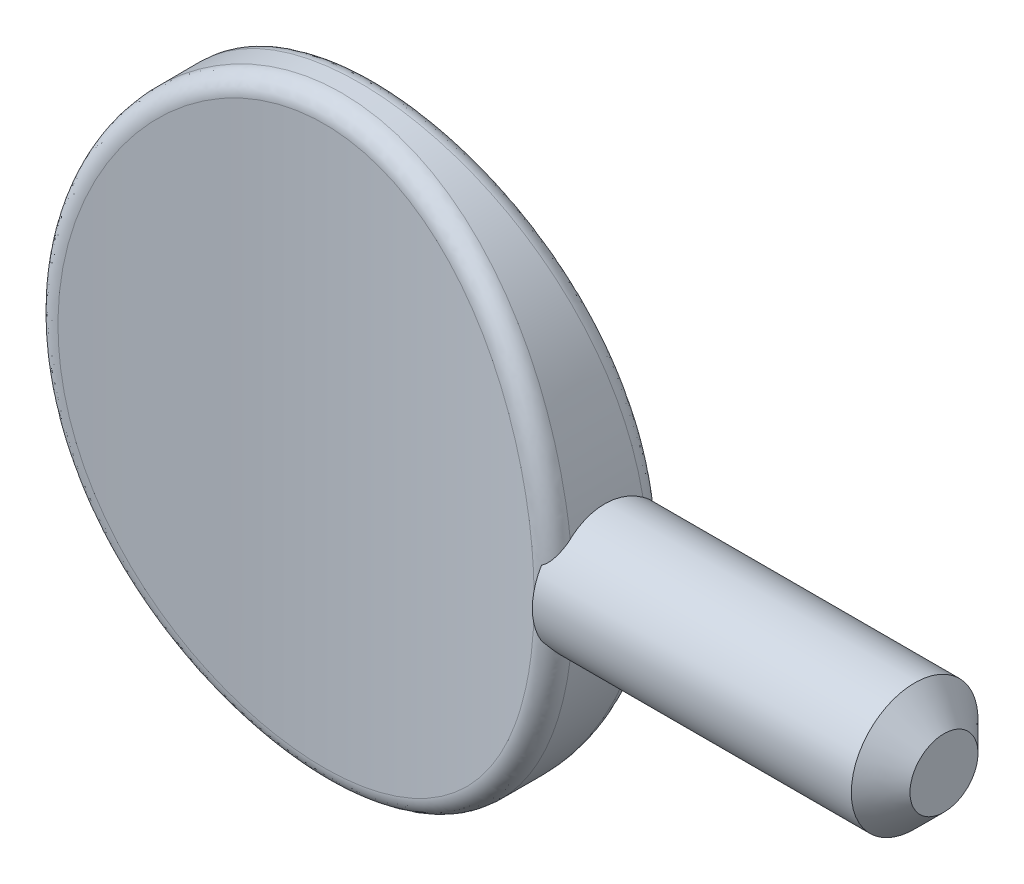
ISO-10303-21;
HEADER;
FILE_DESCRIPTION(('STEP AP214'),'2;1');
FILE_NAME('part.step','',(''),(''),'','','');
FILE_SCHEMA(('AUTOMOTIVE_DESIGN { 1 0 10303 214 1 1 1 1 }'));
ENDSEC;
DATA;
#1=APPLICATION_CONTEXT('core data for automotive mechanical design processes');
#2=APPLICATION_PROTOCOL_DEFINITION('international standard','automotive_design',2000,#1);
#3=PRODUCT_CONTEXT('',#1,'mechanical');
#4=PRODUCT('Part','Part','',(#3));
#5=PRODUCT_RELATED_PRODUCT_CATEGORY('part','',(#4));
#6=PRODUCT_DEFINITION_FORMATION('','',#4);
#7=PRODUCT_DEFINITION_CONTEXT('part definition',#1,'design');
#8=PRODUCT_DEFINITION('design','',#6,#7);
#9=PRODUCT_DEFINITION_SHAPE('','',#8);
#10=(LENGTH_UNIT() NAMED_UNIT(*) SI_UNIT(.MILLI.,.METRE.));
#11=(NAMED_UNIT(*) PLANE_ANGLE_UNIT() SI_UNIT($,.RADIAN.));
#12=(NAMED_UNIT(*) SI_UNIT($,.STERADIAN.) SOLID_ANGLE_UNIT());
#13=UNCERTAINTY_MEASURE_WITH_UNIT(LENGTH_MEASURE(1.E-05),#10,'distance_accuracy_value','');
#14=(GEOMETRIC_REPRESENTATION_CONTEXT(3) GLOBAL_UNCERTAINTY_ASSIGNED_CONTEXT((#13)) GLOBAL_UNIT_ASSIGNED_CONTEXT((#10,
#11,#12)) REPRESENTATION_CONTEXT('',''));
#15=CARTESIAN_POINT('',(0.,0.,0.));
#16=DIRECTION('',(0.,0.,1.));
#17=DIRECTION('',(1.,0.,0.));
#18=AXIS2_PLACEMENT_3D('',#15,#16,#17);
#19=CARTESIAN_POINT('',(0.,0.,2.286));
#20=DIRECTION('',(0.,0.,1.));
#21=DIRECTION('',(0.,-1.,0.));
#22=AXIS2_PLACEMENT_3D('',#19,#20,#21);
#23=ELLIPSE('',#22,11.303,9.906);
#24=DIRECTION('',(0.,0.,-1.));
#25=VECTOR('',#24,1.);
#26=SURFACE_OF_LINEAR_EXTRUSION('',#23,#25);
#27=CARTESIAN_POINT('',(9.7599834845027,-1.93354475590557,1.44359747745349));
#28=CARTESIAN_POINT('',(9.7538599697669,-1.97377990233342,1.3897162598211));
#29=CARTESIAN_POINT('',(9.74788480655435,-2.01176072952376,1.33413671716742));
#30=CARTESIAN_POINT('',(9.73639068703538,-2.08297198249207,1.21996586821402));
#31=CARTESIAN_POINT('',(9.73087174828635,-2.11620222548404,1.1613744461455));
#32=CARTESIAN_POINT('',(9.72044940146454,-2.17767139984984,1.04156116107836));
#33=CARTESIAN_POINT('',(9.71554607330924,-2.20590968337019,0.980338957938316));
#34=CARTESIAN_POINT('',(9.70649644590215,-2.25717945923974,0.855719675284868));
#35=CARTESIAN_POINT('',(9.70235011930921,-2.28021113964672,0.792322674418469));
#36=CARTESIAN_POINT('',(9.69123192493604,-2.34125083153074,0.59939431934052));
#37=CARTESIAN_POINT('',(9.68558076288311,-2.37120394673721,0.46712472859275));
#38=CARTESIAN_POINT('',(9.67850306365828,-2.40853619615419,0.199478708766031));
#39=CARTESIAN_POINT('',(9.67707378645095,-2.4159299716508,0.064104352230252));
#40=CARTESIAN_POINT('',(9.67858617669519,-2.40802787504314,-0.204493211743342));
#41=CARTESIAN_POINT('',(9.68148053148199,-2.39297760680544,-0.33772381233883));
#42=CARTESIAN_POINT('',(9.6912194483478,-2.34108806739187,-0.599771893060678));
#43=CARTESIAN_POINT('',(9.69806554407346,-2.30424033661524,-0.728587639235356));
#44=CARTESIAN_POINT('',(9.7137074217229,-2.21664920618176,-0.960257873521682));
#45=CARTESIAN_POINT('',(9.72208273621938,-2.16865680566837,-1.06418600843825));
#46=CARTESIAN_POINT('',(9.73584734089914,-2.0861466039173,-1.21400793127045));
#47=CARTESIAN_POINT('',(9.74063407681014,-2.05690073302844,-1.26292205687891));
#48=CARTESIAN_POINT('',(9.7505120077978,-1.99503672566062,-1.35854295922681));
#49=CARTESIAN_POINT('',(9.7556032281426,-1.96241830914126,-1.40524955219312));
#50=CARTESIAN_POINT('',(9.76079800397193,-1.92818422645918,-1.45074966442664));
#51=B_SPLINE_CURVE_WITH_KNOTS('',3,(#27,#28,#29,#30,#31,#32,#33,#34,#35,#36,#37,#38,#39,#40,#41,
#42,#43,#44,#45,#46,#47,#48,#49,#50),.UNSPECIFIED.,.F.,.F.,(4,2,2,2,2,2,2,2,2,2,2,4),(0.,
0.202511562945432,0.405030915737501,0.607576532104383,0.810114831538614,1.2151884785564,
1.61999917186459,2.02041242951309,2.42098118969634,2.7640979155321,2.93554569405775,
3.10700772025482),.UNSPECIFIED.);
#52=CARTESIAN_POINT('',(9.75349384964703,-1.97571933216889,1.3853166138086));
#53=VERTEX_POINT('',#52);
#54=CARTESIAN_POINT('',(9.75349384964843,-1.97571933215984,-1.38531661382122));
#55=VERTEX_POINT('',#54);
#56=EDGE_CURVE('E64',#53,#55,#51,.T.);
#57=ORIENTED_EDGE('',*,*,#56,.F.);
#58=CARTESIAN_POINT('',(9.06433649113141,-0.441553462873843,2.07648141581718));
#59=CARTESIAN_POINT('',(9.89731087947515,-0.473374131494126,2.27409385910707));
#60=CARTESIAN_POINT('',(9.8975763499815,-0.466033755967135,1.41744012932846));
#61=CARTESIAN_POINT('',(9.04072988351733,-1.10521542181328,2.07087783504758));
#62=CARTESIAN_POINT('',(9.87118982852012,-1.18437600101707,2.26734926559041));
#63=CARTESIAN_POINT('',(9.87223120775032,-1.16650607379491,1.41173989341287));
#64=CARTESIAN_POINT('',(8.96387282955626,-1.76690913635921,2.05255322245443));
#65=CARTESIAN_POINT('',(9.78656612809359,-1.8914413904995,2.24540170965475));
#66=CARTESIAN_POINT('',(9.78972693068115,-1.86500634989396,1.39309920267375));
#67=CARTESIAN_POINT('',(8.70423897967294,-3.06740809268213,1.9926113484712));
#68=CARTESIAN_POINT('',(9.49942015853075,-3.28368426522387,2.17332598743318));
#69=CARTESIAN_POINT('',(9.5106965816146,-3.23896299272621,1.33212340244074));
#70=CARTESIAN_POINT('',(8.52144099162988,-3.70620872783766,1.95098942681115));
#71=CARTESIAN_POINT('',(9.29855203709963,-3.96503959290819,2.1236030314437));
#72=CARTESIAN_POINT('',(9.3141476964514,-3.9144147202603,1.28978355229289));
#73=CARTESIAN_POINT('',(8.0522372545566,-4.93844637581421,1.84970425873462));
#74=CARTESIAN_POINT('',(8.78113980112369,-5.28032485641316,2.00228764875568));
#75=CARTESIAN_POINT('',(8.8087223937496,-5.21927582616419,1.18675133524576));
#76=CARTESIAN_POINT('',(7.76638400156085,-5.53210522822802,1.79013749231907));
#77=CARTESIAN_POINT('',(8.46783563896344,-5.91194692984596,1.93136369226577));
#78=CARTESIAN_POINT('',(8.50044492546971,-5.84890960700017,1.12615711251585));
#79=CARTESIAN_POINT('',(7.26256698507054,-6.37458445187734,1.69306358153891));
#80=CARTESIAN_POINT('',(7.9123102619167,-6.81102173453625,1.81528163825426));
#81=CARTESIAN_POINT('',(7.95575827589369,-6.74427599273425,1.02740879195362));
#82=CARTESIAN_POINT('',(7.08198860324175,-6.64756129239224,1.65939540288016));
#83=CARTESIAN_POINT('',(7.71435000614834,-7.10090761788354,1.77525192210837));
#84=CARTESIAN_POINT('',(7.76033985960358,-7.03471301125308,0.993159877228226));
#85=CARTESIAN_POINT('',(6.69635721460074,-7.17472703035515,1.59067374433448));
#86=CARTESIAN_POINT('',(7.2916832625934,-7.66016806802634,1.69362011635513));
#87=CARTESIAN_POINT('',(7.34247562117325,-7.59625745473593,0.923252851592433));
#88=CARTESIAN_POINT('',(6.49131885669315,-7.42892702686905,1.55562110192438));
#89=CARTESIAN_POINT('',(7.06731807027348,-7.92959161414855,1.65205176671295));
#90=CARTESIAN_POINT('',(7.12004597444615,-7.86737629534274,0.88759559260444));
#91=CARTESIAN_POINT('',(6.07339660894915,-7.89779481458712,1.48797563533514));
#92=CARTESIAN_POINT('',(6.61001404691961,-8.42614113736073,1.5718945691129));
#93=CARTESIAN_POINT('',(6.66603588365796,-8.36809358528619,0.818783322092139));
#94=CARTESIAN_POINT('',(5.8621693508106,-8.11399325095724,1.45538942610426));
#95=CARTESIAN_POINT('',(6.37923621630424,-8.65490610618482,1.53333835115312));
#96=CARTESIAN_POINT('',(6.43629914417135,-8.59927776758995,0.785635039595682));
#97=CARTESIAN_POINT('',(5.420462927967,-8.52495389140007,1.39126982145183));
#98=CARTESIAN_POINT('',(5.89686229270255,-9.08924875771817,1.45756148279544));
#99=CARTESIAN_POINT('',(5.95522830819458,-9.03927334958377,0.720409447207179));
#100=CARTESIAN_POINT('',(5.18999529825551,-8.71972877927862,1.3597358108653));
#101=CARTESIAN_POINT('',(5.64541451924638,-9.2950474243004,1.42032518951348));
#102=CARTESIAN_POINT('',(5.70390714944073,-9.24809798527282,0.688331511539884));
#103=CARTESIAN_POINT('',(4.7112180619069,-9.08513182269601,1.29889201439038));
#104=CARTESIAN_POINT('',(5.12333296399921,-9.68063953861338,1.34857362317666));
#105=CARTESIAN_POINT('',(5.18108360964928,-9.64035101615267,0.626438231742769));
#106=CARTESIAN_POINT('',(4.46292238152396,-9.25577852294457,1.26958052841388));
#107=CARTESIAN_POINT('',(4.85275176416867,-9.86072624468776,1.31402128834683));
#108=CARTESIAN_POINT('',(4.9095969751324,-9.82379891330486,0.596621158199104));
#109=CARTESIAN_POINT('',(3.95012425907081,-9.5703567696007,1.21433232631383));
#110=CARTESIAN_POINT('',(4.29427737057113,-10.1922417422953,1.2489893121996));
#111=CARTESIAN_POINT('',(4.34815021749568,-10.1623803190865,0.540419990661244));
#112=CARTESIAN_POINT('',(3.68562512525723,-9.71429374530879,1.18839492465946));
#113=CARTESIAN_POINT('',(4.00630404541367,-10.3439928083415,1.21845738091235));
#114=CARTESIAN_POINT('',(4.05819386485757,-10.3175195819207,0.51403519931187));
#115=CARTESIAN_POINT('',(3.18095813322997,-9.95464296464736,1.14434912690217));
#116=CARTESIAN_POINT('',(3.45702558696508,-10.5971097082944,1.1666698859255));
#117=CARTESIAN_POINT('',(3.50428103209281,-10.5768490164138,0.469229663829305));
#118=CARTESIAN_POINT('',(2.94260311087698,-10.0548925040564,1.12565265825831));
#119=CARTESIAN_POINT('',(3.19771589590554,-10.7026948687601,1.14469031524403));
#120=CARTESIAN_POINT('',(3.2424065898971,-10.6851365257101,0.450210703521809));
#121=CARTESIAN_POINT('',(2.45745188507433,-10.2322329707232,1.09221652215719));
#122=CARTESIAN_POINT('',(2.67025548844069,-10.8892399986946,1.10543443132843));
#123=CARTESIAN_POINT('',(2.70890894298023,-10.8768424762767,0.416197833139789));
#124=CARTESIAN_POINT('',(2.21065722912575,-10.3093281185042,1.0774761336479));
#125=CARTESIAN_POINT('',(2.40189348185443,-10.9703962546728,1.08811890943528));
#126=CARTESIAN_POINT('',(2.43728752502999,-10.96026544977,0.401203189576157));
#127=CARTESIAN_POINT('',(1.71091716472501,-10.4390517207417,1.05249286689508));
#128=CARTESIAN_POINT('',(1.85884865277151,-11.1067770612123,1.05881030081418));
#129=CARTESIAN_POINT('',(1.88689681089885,-11.1007143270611,0.375788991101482));
#130=CARTESIAN_POINT('',(1.45797707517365,-10.4917005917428,1.04224623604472));
#131=CARTESIAN_POINT('',(1.58389234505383,-11.1621799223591,1.04677989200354));
#132=CARTESIAN_POINT('',(1.60813368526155,-11.1577622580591,0.365365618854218));
#133=CARTESIAN_POINT('',(0.948114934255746,-10.5716983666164,1.02661952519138));
#134=CARTESIAN_POINT('',(1.03003449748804,-11.2462512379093,1.0284575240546));
#135=CARTESIAN_POINT('',(1.04597206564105,-11.2444700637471,0.349469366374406));
#136=CARTESIAN_POINT('',(0.691193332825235,-10.5990501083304,1.02123889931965));
#137=CARTESIAN_POINT('',(0.75080259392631,-11.2750269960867,1.02214236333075));
#138=CARTESIAN_POINT('',(0.762574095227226,-11.2741330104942,0.343995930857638));
#139=CARTESIAN_POINT('',(0.209209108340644,-10.6261003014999,1.01591573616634));
#140=CARTESIAN_POINT('',(0.227293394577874,-11.3034522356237,1.01590196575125));
#141=CARTESIAN_POINT('',(0.23083451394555,-11.3034697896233,0.338580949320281));
#142=CARTESIAN_POINT('',(-0.0156831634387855,-10.6289136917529,1.0153606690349));
#143=CARTESIAN_POINT('',(-0.0170749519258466,-11.3064105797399,1.01525084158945));
#144=CARTESIAN_POINT('',(-0.0173081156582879,-11.3065216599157,0.338016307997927));
#145=CARTESIAN_POINT('',(-0.464932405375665,-10.6149527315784,1.01810993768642));
#146=CARTESIAN_POINT('',(-0.504998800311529,-11.2917412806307,1.0184735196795));
#147=CARTESIAN_POINT('',(-0.512964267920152,-11.291379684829,0.340812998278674));
#148=CARTESIAN_POINT('',(-0.689289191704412,-10.5981724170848,1.02141544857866));
#149=CARTESIAN_POINT('',(-0.748793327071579,-11.274092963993,1.02235186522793));
#150=CARTESIAN_POINT('',(-0.760477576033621,-11.2731793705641,0.344175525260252));
#151=CARTESIAN_POINT('',(-1.13556884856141,-10.5452601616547,1.0317883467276));
#152=CARTESIAN_POINT('',(-1.2335417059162,-11.2184912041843,1.03451259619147));
#153=CARTESIAN_POINT('',(-1.2526768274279,-11.2158123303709,0.354727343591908));
#154=CARTESIAN_POINT('',(-1.35749296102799,-10.5091386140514,1.03885371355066));
#155=CARTESIAN_POINT('',(-1.47472448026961,-11.1804953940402,1.04280421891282));
#156=CARTESIAN_POINT('',(-1.49736421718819,-11.1766568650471,0.361914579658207));
#157=CARTESIAN_POINT('',(-1.79749977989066,-10.4180266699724,1.05654330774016));
#158=CARTESIAN_POINT('',(-1.9527689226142,-11.0847276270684,1.06355029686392));
#159=CARTESIAN_POINT('',(-1.98226996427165,-11.0779503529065,0.379909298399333));
#160=CARTESIAN_POINT('',(-2.01558099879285,-10.3630291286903,1.06716888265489));
#161=CARTESIAN_POINT('',(-2.18983193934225,-11.0268610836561,1.07602492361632));
#162=CARTESIAN_POINT('',(-2.22248659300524,-11.0183915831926,0.390718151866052));
#163=CARTESIAN_POINT('',(-2.44049679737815,-10.2366111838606,1.09134888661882));
#164=CARTESIAN_POINT('',(-2.65162302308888,-10.8939375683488,1.10439715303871));
#165=CARTESIAN_POINT('',(-2.69022849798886,-10.8815920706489,0.415315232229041));
#166=CARTESIAN_POINT('',(-2.64747600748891,-10.1656759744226,1.10481618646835));
#167=CARTESIAN_POINT('',(-2.87668834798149,-10.8192776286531,1.12021587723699));
#168=CARTESIAN_POINT('',(-2.91792129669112,-10.8048739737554,0.429014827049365));
#169=CARTESIAN_POINT('',(-3.05512217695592,-10.0074393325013,1.13449174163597));
#170=CARTESIAN_POINT('',(-3.31994587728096,-10.6528031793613,1.15506402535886));
#171=CARTESIAN_POINT('',(-3.36602555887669,-10.6338821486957,0.459202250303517));
#172=CARTESIAN_POINT('',(-3.25578691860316,-9.92013222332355,1.15070094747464));
#173=CARTESIAN_POINT('',(-3.53825524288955,-10.5608636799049,1.17411805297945));
#174=CARTESIAN_POINT('',(-3.58643446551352,-10.5396023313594,0.47569104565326));
#175=CARTESIAN_POINT('',(-3.84654426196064,-9.63504101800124,1.20285461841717));
#176=CARTESIAN_POINT('',(-4.18237180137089,-10.2600882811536,1.2355487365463));
#177=CARTESIAN_POINT('',(-4.23476308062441,-10.2320328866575,0.528744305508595));
#178=CARTESIAN_POINT('',(-4.22571339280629,-9.41399224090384,1.24234388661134));
#179=CARTESIAN_POINT('',(-4.59539551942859,-10.0267310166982,1.28209163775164));
#180=CARTESIAN_POINT('',(-4.65012975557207,-9.99391046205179,0.568914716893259));
#181=CARTESIAN_POINT('',(-4.97579964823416,-8.89885031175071,1.3305459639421));
#182=CARTESIAN_POINT('',(-5.41315254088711,-9.48328684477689,1.38604753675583));
#183=CARTESIAN_POINT('',(-5.4703040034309,-9.44018886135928,0.658638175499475));
#184=CARTESIAN_POINT('',(-5.34372659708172,-8.60038202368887,1.37973973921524));
#185=CARTESIAN_POINT('',(-5.81438792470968,-9.16774150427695,1.44414433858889));
#186=CARTESIAN_POINT('',(-5.87171654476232,-9.11997166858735,0.708680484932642));
#187=CARTESIAN_POINT('',(-6.03184666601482,-7.95150761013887,1.4804681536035));
#188=CARTESIAN_POINT('',(-6.56597991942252,-8.48184990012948,1.56320931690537));
#189=CARTESIAN_POINT('',(-6.62102535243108,-8.42537982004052,0.811146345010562));
#190=CARTESIAN_POINT('',(-6.35201943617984,-7.60107946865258,1.53200377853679));
#191=CARTESIAN_POINT('',(-6.91576322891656,-8.11070576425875,1.62422932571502));
#192=CARTESIAN_POINT('',(-6.96889880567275,-8.05098220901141,0.863570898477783));
#193=CARTESIAN_POINT('',(-6.97998081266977,-6.80920807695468,1.63984325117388));
#194=CARTESIAN_POINT('',(-7.60405609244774,-7.27066586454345,1.75228632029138));
#195=CARTESIAN_POINT('',(-7.65003938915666,-7.20661845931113,0.973270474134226));
#196=CARTESIAN_POINT('',(-7.28060968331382,-6.36185596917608,1.69588343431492));
#197=CARTESIAN_POINT('',(-7.93313272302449,-6.79574608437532,1.81884441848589));
#198=CARTESIAN_POINT('',(-7.97537608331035,-6.73055907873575,1.03027728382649));
#199=CARTESIAN_POINT('',(-7.81370754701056,-5.42598150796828,1.8002849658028));
#200=CARTESIAN_POINT('',(-8.51893240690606,-5.80032940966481,1.94329479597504));
#201=CARTESIAN_POINT('',(-8.55143234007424,-5.73641613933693,1.13647961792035));
#202=CARTESIAN_POINT('',(-8.04612685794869,-4.93742947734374,1.84864070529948));
#203=CARTESIAN_POINT('',(-8.77401400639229,-5.2803139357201,2.00093018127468));
#204=CARTESIAN_POINT('',(-8.80209751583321,-5.21830229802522,1.18566943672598));
#205=CARTESIAN_POINT('',(-8.46579777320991,-3.86798278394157,1.93874221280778));
#206=CARTESIAN_POINT('',(-9.23695256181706,-4.13843974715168,2.10886875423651));
#207=CARTESIAN_POINT('',(-9.25424841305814,-4.08562792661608,1.27732508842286));
#208=CARTESIAN_POINT('',(-8.6437754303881,-3.28317788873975,1.97890682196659));
#209=CARTESIAN_POINT('',(-9.43263150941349,-3.5145810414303,2.15687234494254));
#210=CARTESIAN_POINT('',(-9.4456739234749,-3.46710594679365,1.31818248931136));
#211=CARTESIAN_POINT('',(-8.90988228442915,-2.09221318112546,2.03992221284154));
#212=CARTESIAN_POINT('',(-9.72684753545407,-2.24001917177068,2.2302091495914));
#213=CARTESIAN_POINT('',(-9.73173019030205,-2.20856660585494,1.38025032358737));
#214=CARTESIAN_POINT('',(-8.99807319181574,-1.48606833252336,2.06078625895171));
#215=CARTESIAN_POINT('',(-9.82401541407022,-1.59219662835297,2.25521159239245));
#216=CARTESIAN_POINT('',(-9.82642742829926,-1.56856432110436,1.40147425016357));
#217=CARTESIAN_POINT('',(-9.07155097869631,-0.448175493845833,2.07818799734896));
#218=CARTESIAN_POINT('',(-9.90531304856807,-0.480096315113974,2.27615280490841));
#219=CARTESIAN_POINT('',(-9.9053231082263,-0.472998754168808,1.41917614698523));
#220=CARTESIAN_POINT('',(-9.07960069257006,-0.0180241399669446,2.08010539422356));
#221=CARTESIAN_POINT('',(-9.91421749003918,-0.0195018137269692,2.2784597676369));
#222=CARTESIAN_POINT('',(-9.91396460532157,-0.0190320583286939,1.42112661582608));
#223=CARTESIAN_POINT('',(-9.05114135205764,0.840874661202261,2.07334832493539));
#224=CARTESIAN_POINT('',(-9.8827087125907,0.901272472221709,2.27032260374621));
#225=CARTESIAN_POINT('',(-9.88340958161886,0.887501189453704,1.41425299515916));
#226=CARTESIAN_POINT('',(-9.01462354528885,1.26962181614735,2.06467177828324));
#227=CARTESIAN_POINT('',(-9.84236732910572,1.36026082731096,2.25989703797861));
#228=CARTESIAN_POINT('',(-9.84420366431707,1.34006744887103,1.40542678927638));
#229=CARTESIAN_POINT('',(-8.90937536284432,2.0316986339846,2.0400225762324));
#230=CARTESIAN_POINT('',(-9.72583784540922,2.17696234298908,2.23022004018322));
#231=CARTESIAN_POINT('',(-9.73114985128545,2.14477756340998,1.38035241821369));
#232=CARTESIAN_POINT('',(-8.8489354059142,2.3663077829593,2.02594526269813));
#233=CARTESIAN_POINT('',(-9.65907544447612,2.53501090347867,2.21331194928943));
#234=CARTESIAN_POINT('',(-9.66621476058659,2.49821035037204,1.3660322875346));
#235=CARTESIAN_POINT('',(-8.70028670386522,3.02889346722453,1.99186677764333));
#236=CARTESIAN_POINT('',(-9.49474440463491,3.24406808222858,2.17235903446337));
#237=CARTESIAN_POINT('',(-9.50642120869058,3.19839647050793,1.33136598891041));
#238=CARTESIAN_POINT('',(-8.61207087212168,3.35686828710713,1.97186409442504));
#239=CARTESIAN_POINT('',(-9.39741618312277,3.59458478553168,2.14837201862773));
#240=CARTESIAN_POINT('',(-9.41155511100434,3.54514807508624,1.31101828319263));
#241=CARTESIAN_POINT('',(-8.40792982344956,4.00383954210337,1.92654702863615));
#242=CARTESIAN_POINT('',(-9.17207272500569,4.28589025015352,2.09402079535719));
#243=CARTESIAN_POINT('',(-9.19186339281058,4.22959703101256,1.26491955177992));
#244=CARTESIAN_POINT('',(-8.29197010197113,4.32282423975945,1.90122603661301));
#245=CARTESIAN_POINT('',(-9.04433751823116,4.62626387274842,2.06371975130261));
#246=CARTESIAN_POINT('',(-9.06700046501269,4.56728252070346,1.2391618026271));
#247=CARTESIAN_POINT('',(-8.03266921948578,4.94864016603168,1.84612445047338));
#248=CARTESIAN_POINT('',(-8.75862164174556,5.29375063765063,1.9977928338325));
#249=CARTESIAN_POINT('',(-8.7875357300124,5.23032676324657,1.18310977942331));
#250=CARTESIAN_POINT('',(-7.88933080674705,5.25547261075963,1.8163443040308));
#251=CARTESIAN_POINT('',(-8.60101160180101,5.6205680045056,1.96224124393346));
#252=CARTESIAN_POINT('',(-8.63293690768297,5.55568674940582,1.1528159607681));
#253=CARTESIAN_POINT('',(-7.5827057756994,5.84065532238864,1.75476032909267));
#254=CARTESIAN_POINT('',(-8.26377031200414,6.24355498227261,1.88874534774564));
#255=CARTESIAN_POINT('',(-8.30186425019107,6.1768129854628,1.09016973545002));
#256=CARTESIAN_POINT('',(-7.42060725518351,6.11966595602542,1.72310789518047));
#257=CARTESIAN_POINT('',(-8.08585157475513,6.54018510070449,1.85105198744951));
#258=CARTESIAN_POINT('',(-8.12668803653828,6.47325210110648,1.05797133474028));
#259=CARTESIAN_POINT('',(-7.07231803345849,6.66122664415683,1.65771330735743));
#260=CARTESIAN_POINT('',(-7.70361694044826,7.11546435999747,1.77323427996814));
#261=CARTESIAN_POINT('',(-7.74985395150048,7.04926217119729,0.991448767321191));
#262=CARTESIAN_POINT('',(-6.88614017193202,6.92378536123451,1.62397227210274));
#263=CARTESIAN_POINT('',(-7.49964582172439,7.39408379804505,1.73315517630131));
#264=CARTESIAN_POINT('',(-7.54821019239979,7.3288419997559,0.957125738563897));
#265=CARTESIAN_POINT('',(-6.49029818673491,7.42975304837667,1.55555294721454));
#266=CARTESIAN_POINT('',(-7.06608461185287,7.93046508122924,1.65196090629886));
#267=CARTESIAN_POINT('',(-7.11892134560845,7.86825729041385,0.887526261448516));
#268=CARTESIAN_POINT('',(-6.2806366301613,7.67316410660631,1.52087476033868));
#269=CARTESIAN_POINT('',(-6.83678956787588,8.1883058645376,1.6108692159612));
#270=CARTESIAN_POINT('',(-6.89127909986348,8.12809490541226,0.852249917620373));
#271=CARTESIAN_POINT('',(-5.8388607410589,8.13772708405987,1.45187677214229));
#272=CARTESIAN_POINT('',(-6.35382230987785,8.67984460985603,1.52920305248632));
#273=CARTESIAN_POINT('',(-6.41093575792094,8.624649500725,0.782061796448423));
#274=CARTESIAN_POINT('',(-5.60676139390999,8.35889366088,1.417556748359));
#275=CARTESIAN_POINT('',(-6.10038934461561,8.91374416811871,1.48862685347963));
#276=CARTESIAN_POINT('',(-6.15825138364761,8.86138170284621,0.747149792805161));
#277=CARTESIAN_POINT('',(-5.14547789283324,8.75521824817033,1.35394959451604));
#278=CARTESIAN_POINT('',(-5.59675257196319,9.33250836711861,1.41349407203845));
#279=CARTESIAN_POINT('',(-5.65531654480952,9.28616485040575,0.68244549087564));
#280=CARTESIAN_POINT('',(-4.91829844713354,8.9327643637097,1.32450134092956));
#281=CARTESIAN_POINT('',(-5.34900946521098,9.5200007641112,1.37874615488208));
#282=CARTESIAN_POINT('',(-5.40732214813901,9.47671576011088,0.652489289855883));
#283=CARTESIAN_POINT('',(-4.44814344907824,9.26490654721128,1.26802841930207));
#284=CARTESIAN_POINT('',(-4.8365814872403,9.87031362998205,1.31219664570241));
#285=CARTESIAN_POINT('',(-4.89341430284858,9.833611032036,0.595042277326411));
#286=CARTESIAN_POINT('',(-4.20517788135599,9.41951692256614,1.24100224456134));
#287=CARTESIAN_POINT('',(-4.57190339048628,10.0334050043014,1.28035681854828));
#288=CARTESIAN_POINT('',(-4.62751217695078,9.99997048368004,0.56754993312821));
#289=CARTESIAN_POINT('',(-3.7052575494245,9.7034163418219,1.1903933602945));
#290=CARTESIAN_POINT('',(-4.02765051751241,10.332475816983,1.22081747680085));
#291=CARTESIAN_POINT('',(-4.07971355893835,10.3057842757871,0.516068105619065));
#292=CARTESIAN_POINT('',(-3.44831525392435,9.83272749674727,1.16680764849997));
#293=CARTESIAN_POINT('',(-3.74797965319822,10.4687607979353,1.19306613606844));
#294=CARTESIAN_POINT('',(-3.79783131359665,10.4452621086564,0.492075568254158));
#295=CARTESIAN_POINT('',(-2.92242796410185,10.0639380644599,1.12400959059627));
#296=CARTESIAN_POINT('',(-3.17597688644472,10.7120881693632,1.14278503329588));
#297=CARTESIAN_POINT('',(-3.22025584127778,10.6948915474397,0.448539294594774));
#298=CARTESIAN_POINT('',(-2.65348535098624,10.1658428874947,1.10479638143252));
#299=CARTESIAN_POINT('',(-2.88342317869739,10.8194170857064,1.12020062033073));
#300=CARTESIAN_POINT('',(-2.92456535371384,10.8050489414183,0.428994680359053));
#301=CARTESIAN_POINT('',(-2.14710069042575,10.3272733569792,1.07404899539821));
#302=CARTESIAN_POINT('',(-2.33284413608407,10.9892348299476,1.08410380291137));
#303=CARTESIAN_POINT('',(-2.36731608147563,10.9796823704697,0.39771693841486));
#304=CARTESIAN_POINT('',(-1.91094499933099,10.3908533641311,1.06179682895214));
#305=CARTESIAN_POINT('',(-2.0761007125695,11.0561454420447,1.06971620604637));
#306=CARTESIAN_POINT('',(-2.10724644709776,11.0485217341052,0.385253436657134));
#307=CARTESIAN_POINT('',(-1.43374613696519,10.4958098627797,1.04145662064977));
#308=CARTESIAN_POINT('',(-1.55762642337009,11.1664699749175,1.04586002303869));
#309=CARTESIAN_POINT('',(-1.5814284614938,11.162210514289,0.364562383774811));
#310=CARTESIAN_POINT('',(-1.1927036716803,10.5371895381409,1.03336798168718));
#311=CARTESIAN_POINT('',(-1.295640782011,11.2100047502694,1.03636574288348));
#312=CARTESIAN_POINT('',(-1.31568093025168,11.2070633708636,0.356334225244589));
#313=CARTESIAN_POINT('',(-0.707915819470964,10.5970726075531,1.02163323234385));
#314=CARTESIAN_POINT('',(-0.769059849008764,11.2729324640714,1.02260821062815));
#315=CARTESIAN_POINT('',(-0.781028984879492,11.2719859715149,0.344397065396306));
#316=CARTESIAN_POINT('',(-0.464172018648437,10.6155887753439,1.01798464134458));
#317=CARTESIAN_POINT('',(-0.504175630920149,11.2924099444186,1.01832657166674));
#318=CARTESIAN_POINT('',(-0.512126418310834,11.2920695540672,0.340685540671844));
#319=CARTESIAN_POINT('',(0.0239742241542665,10.6294808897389,1.01524901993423));
#320=CARTESIAN_POINT('',(0.0259922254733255,11.3070062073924,1.01512004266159));
#321=CARTESIAN_POINT('',(0.0264470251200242,11.3071368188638,0.337902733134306));
#322=CARTESIAN_POINT('',(0.268376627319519,10.6248581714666,1.01616172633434));
#323=CARTESIAN_POINT('',(0.291583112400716,11.3021433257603,1.01619112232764));
#324=CARTESIAN_POINT('',(0.296117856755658,11.3021219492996,0.338831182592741));
#325=CARTESIAN_POINT('',(0.731015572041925,10.5941897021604,1.02219342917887));
#326=CARTESIAN_POINT('',(0.794042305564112,11.2699210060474,1.02326107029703));
#327=CARTESIAN_POINT('',(0.806497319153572,11.2688626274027,0.344966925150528));
#328=CARTESIAN_POINT('',(0.949402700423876,10.5703538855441,1.02687846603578));
#329=CARTESIAN_POINT('',(1.03135419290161,11.244851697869,1.02875824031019));
#330=CARTESIAN_POINT('',(1.04738130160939,11.2430144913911,0.34973277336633));
#331=CARTESIAN_POINT('',(1.38344630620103,10.5043595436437,1.03977653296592));
#332=CARTESIAN_POINT('',(1.50284665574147,11.1754967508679,1.04388124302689));
#333=CARTESIAN_POINT('',(1.52596681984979,11.1714816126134,0.362853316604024));
#334=CARTESIAN_POINT('',(1.59910191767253,10.4621953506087,1.04799065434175));
#335=CARTESIAN_POINT('',(1.73723082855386,11.1311427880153,1.053521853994));
#336=CARTESIAN_POINT('',(1.76366734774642,11.1257907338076,0.371209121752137));
#337=CARTESIAN_POINT('',(2.02606245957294,10.3600924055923,1.06772057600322));
#338=CARTESIAN_POINT('',(2.20115032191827,11.0238097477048,1.07666464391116));
#339=CARTESIAN_POINT('',(2.23402228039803,11.0152178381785,0.39127936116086));
#340=CARTESIAN_POINT('',(2.23736912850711,10.3001609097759,1.0792350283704));
#341=CARTESIAN_POINT('',(2.43086687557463,10.9607473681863,1.09018446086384));
#342=CARTESIAN_POINT('',(2.46667870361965,10.9503436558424,0.402992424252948));
#343=CARTESIAN_POINT('',(2.65441619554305,10.1632551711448,1.10525920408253));
#344=CARTESIAN_POINT('',(2.88420079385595,10.8167652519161,1.12072955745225));
#345=CARTESIAN_POINT('',(2.92555248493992,10.8022616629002,0.429465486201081));
#346=CARTESIAN_POINT('',(2.86015443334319,10.0862744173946,1.11977007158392));
#347=CARTESIAN_POINT('',(3.10796098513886,10.7357272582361,1.13777888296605));
#348=CARTESIAN_POINT('',(3.15176734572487,10.7190468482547,0.444226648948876));
#349=CARTESIAN_POINT('',(3.47229190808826,9.82882926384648,1.16766697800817));
#350=CARTESIAN_POINT('',(3.77502068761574,10.4642750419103,1.19415299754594));
#351=CARTESIAN_POINT('',(3.82428787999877,10.4410018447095,0.492949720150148));
#352=CARTESIAN_POINT('',(3.8683972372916,9.62312725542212,1.20516354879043));
#353=CARTESIAN_POINT('',(4.20637914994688,10.2471702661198,1.23832898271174));
#354=CARTESIAN_POINT('',(4.25872054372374,10.2191448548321,0.531093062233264));
#355=CARTESIAN_POINT('',(4.62459293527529,9.15366768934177,1.28740400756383));
#356=CARTESIAN_POINT('',(5.03001761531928,9.75240293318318,1.33514205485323));
#357=CARTESIAN_POINT('',(5.08654839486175,9.71393277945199,0.614752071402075));
#358=CARTESIAN_POINT('',(4.9846713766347,8.88989099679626,1.33215028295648));
#359=CARTESIAN_POINT('',(5.42252640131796,9.47370233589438,1.38794594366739));
#360=CARTESIAN_POINT('',(5.47992999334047,9.43055742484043,0.660270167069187));
#361=CARTESIAN_POINT('',(5.69889695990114,8.28317315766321,1.42989181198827));
#362=CARTESIAN_POINT('',(6.20241802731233,8.83257556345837,1.50340477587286));
#363=CARTESIAN_POINT('',(6.25876561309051,8.78017530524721,0.759697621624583));
#364=CARTESIAN_POINT('',(6.04858866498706,7.93486893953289,1.48326169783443));
#365=CARTESIAN_POINT('',(6.5841873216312,8.46389482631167,1.56654004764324));
#366=CARTESIAN_POINT('',(6.63920256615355,8.40755316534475,0.813988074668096));
#367=CARTESIAN_POINT('',(6.69355774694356,7.18955442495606,1.58930188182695));
#368=CARTESIAN_POINT('',(7.28996031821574,7.6745484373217,1.69221318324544));
#369=CARTESIAN_POINT('',(7.33958984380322,7.61192292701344,0.921857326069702));
#370=CARTESIAN_POINT('',(6.98880792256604,6.79251994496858,1.64197181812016));
#371=CARTESIAN_POINT('',(7.61298151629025,7.25337948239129,1.7547092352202));
#372=CARTESIAN_POINT('',(7.65950993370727,7.18888981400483,0.975435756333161));
#373=CARTESIAN_POINT('',(7.55852416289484,5.9035257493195,1.74907555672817));
#374=CARTESIAN_POINT('',(8.23879298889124,6.30821299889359,1.88227557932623));
#375=CARTESIAN_POINT('',(8.27589606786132,6.24338332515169,1.08438690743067));
#376=CARTESIAN_POINT('',(7.82473612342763,5.40599546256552,1.80277922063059));
#377=CARTESIAN_POINT('',(8.53065041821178,5.77912309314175,1.94620221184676));
#378=CARTESIAN_POINT('',(8.56329170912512,5.71520536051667,1.13901689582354));
#379=CARTESIAN_POINT('',(8.2814684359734,4.37513696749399,1.89847802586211));
#380=CARTESIAN_POINT('',(9.03367283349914,4.68015804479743,2.06063032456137));
#381=CARTESIAN_POINT('',(9.0557691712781,4.62251452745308,1.23636639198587));
#382=CARTESIAN_POINT('',(8.47195257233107,3.84179177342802,1.94046756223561));
#383=CARTESIAN_POINT('',(9.24305355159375,4.11150478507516,2.11078670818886));
#384=CARTESIAN_POINT('',(9.26081160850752,4.05798442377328,1.27908019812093));
#385=CARTESIAN_POINT('',(8.79277988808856,2.69157447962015,2.01267902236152));
#386=CARTESIAN_POINT('',(9.59762062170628,2.88109997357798,2.19751575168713));
#387=CARTESIAN_POINT('',(9.60591371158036,2.8417227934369,1.35253722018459));
#388=CARTESIAN_POINT('',(8.91415781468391,2.07198286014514,2.04108919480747));
#389=CARTESIAN_POINT('',(9.7312231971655,2.21931200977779,2.23152481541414));
#390=CARTESIAN_POINT('',(9.73629583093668,2.1872462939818,1.38143743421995));
#391=CARTESIAN_POINT('',(9.06115860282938,0.820487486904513,2.07565423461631));
#392=CARTESIAN_POINT('',(9.89394740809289,0.878268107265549,2.27313745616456));
#393=CARTESIAN_POINT('',(9.89417614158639,0.8659119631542,1.41659868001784));
#394=CARTESIAN_POINT('',(9.08675047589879,0.188579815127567,2.08180189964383));
#395=CARTESIAN_POINT('',(9.92214545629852,0.202610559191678,2.28050627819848));
#396=CARTESIAN_POINT('',(9.92164103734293,0.199050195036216,1.42285238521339));
#397=CARTESIAN_POINT('',(9.06433649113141,-0.441553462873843,2.07648141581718));
#398=CARTESIAN_POINT('',(9.89731087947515,-0.473374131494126,2.27409385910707));
#399=CARTESIAN_POINT('',(9.8975763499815,-0.466033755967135,1.41744012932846));
#400=(BOUNDED_SURFACE() B_SPLINE_SURFACE(3,2,((#58,#59,#60),(#61,#62,#63),(#64,#65,#66),(#67,
#68,#69),(#70,#71,#72),(#73,#74,#75),(#76,#77,#78),(#79,#80,#81),(#82,#83,#84),(#85,#86,#87),
(#88,#89,#90),(#91,#92,#93),(#94,#95,#96),(#97,#98,#99),(#100,#101,#102),(#103,#104,#105),(#106,
#107,#108),(#109,#110,#111),(#112,#113,#114),(#115,#116,#117),(#118,#119,#120),(#121,#122,#123),
(#124,#125,#126),(#127,#128,#129),(#130,#131,#132),(#133,#134,#135),(#136,#137,#138),(#139,#140,
#141),(#142,#143,#144),(#145,#146,#147),(#148,#149,#150),(#151,#152,#153),(#154,#155,#156),
(#157,#158,#159),(#160,#161,#162),(#163,#164,#165),(#166,#167,#168),(#169,#170,#171),(#172,#173,
#174),(#175,#176,#177),(#178,#179,#180),(#181,#182,#183),(#184,#185,#186),(#187,#188,#189),
(#190,#191,#192),(#193,#194,#195),(#196,#197,#198),(#199,#200,#201),(#202,#203,#204),(#205,#206,
#207),(#208,#209,#210),(#211,#212,#213),(#214,#215,#216),(#217,#218,#219),(#220,#221,#222),
(#223,#224,#225),(#226,#227,#228),(#229,#230,#231),(#232,#233,#234),(#235,#236,#237),(#238,#239,
#240),(#241,#242,#243),(#244,#245,#246),(#247,#248,#249),(#250,#251,#252),(#253,#254,#255),
(#256,#257,#258),(#259,#260,#261),(#262,#263,#264),(#265,#266,#267),(#268,#269,#270),(#271,#272,
#273),(#274,#275,#276),(#277,#278,#279),(#280,#281,#282),(#283,#284,#285),(#286,#287,#288),
(#289,#290,#291),(#292,#293,#294),(#295,#296,#297),(#298,#299,#300),(#301,#302,#303),(#304,#305,
#306),(#307,#308,#309),(#310,#311,#312),(#313,#314,#315),(#316,#317,#318),(#319,#320,#321),
(#322,#323,#324),(#325,#326,#327),(#328,#329,#330),(#331,#332,#333),(#334,#335,#336),(#337,#338,
#339),(#340,#341,#342),(#343,#344,#345),(#346,#347,#348),(#349,#350,#351),(#352,#353,#354),
(#355,#356,#357),(#358,#359,#360),(#361,#362,#363),(#364,#365,#366),(#367,#368,#369),(#370,#371,
#372),(#373,#374,#375),(#376,#377,#378),(#379,#380,#381),(#382,#383,#384),(#385,#386,#387),
(#388,#389,#390),(#391,#392,#393),(#394,#395,#396),(#397,#398,#399)),.UNSPECIFIED.,.T.,.F.,
.F.) B_SPLINE_SURFACE_WITH_KNOTS((4,2,2,2,2,2,2,2,2,2,2,2,2,2,2,2,2,2,2,2,2,2,2,2,2,2,2,2,2,2,2,
2,2,2,2,2,2,2,2,2,2,2,2,2,2,2,2,2,2,2,2,2,2,2,2,2,4),(3,3),(0.,1.99013383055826,
3.98066589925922,5.9606813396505,6.95189992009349,7.94252781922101,8.86106937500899,
9.77906414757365,10.6963494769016,11.6134481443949,12.4015093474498,13.1894268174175,
13.9766850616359,14.7638549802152,15.4493720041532,16.135097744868,16.8204553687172,
17.5060726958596,18.1731188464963,18.8403967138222,20.1739641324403,21.6123317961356,
23.0513106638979,24.6794364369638,26.3087451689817,28.1416611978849,29.9733166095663,
31.2617105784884,32.5503576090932,33.5706861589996,34.5912752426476,35.6131402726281,
36.6349027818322,37.6106807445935,38.5859405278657,39.5610938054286,40.5356002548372,
41.4132125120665,42.2902749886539,43.1665674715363,44.0426868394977,44.7880998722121,
45.5334059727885,46.2782954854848,47.0231420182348,47.6927906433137,48.3626464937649,
49.0322291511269,49.7020679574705,51.0579388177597,52.4142570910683,53.9106893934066,
55.4078673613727,57.1081651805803,58.8092751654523,60.6982549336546,62.5878457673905),(0.,1.),
.UNSPECIFIED.) GEOMETRIC_REPRESENTATION_ITEM() RATIONAL_B_SPLINE_SURFACE(((1.,0.620209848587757,
1.),(1.,0.620635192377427,1.),(1.,0.622024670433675,1.),(1.,0.626603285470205,1.),(1.,
0.629792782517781,1.),(1.,0.637645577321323,1.),(1.,0.642300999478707,1.),(1.,0.650003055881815,
1.),(1.,0.652692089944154,1.),(1.,0.658224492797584,1.),(1.,0.661067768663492,1.),(1.,
0.666601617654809,1.),(1.,0.669288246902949,1.),(1.,0.674617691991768,1.),(1.,0.677260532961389,
1.),(1.,0.682400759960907,1.),(1.,0.684898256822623,1.),(1.,0.689641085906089,1.),(1.,
0.691886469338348,1.),(1.,0.69572436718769,1.),(1.,0.697364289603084,1.),(1.,0.700310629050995,
1.),(1.,0.701617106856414,1.),(1.,0.703838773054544,1.),(1.,0.704754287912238,1.),(1.,
0.706152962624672,1.),(1.,0.706636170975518,1.),(1.,0.707114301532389,1.),(1.,0.707164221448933,
1.),(1.,0.706917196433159,1.),(1.,0.706620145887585,1.),(1.,0.705690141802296,1.),(1.,
0.705057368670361,1.),(1.,0.703478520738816,1.),(1.,0.702532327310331,1.),(1.,0.700388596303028,
1.),(1.,0.699198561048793,1.),(1.,0.69658926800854,1.),(1.,0.695169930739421,1.),(1.,
0.690628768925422,1.),(1.,0.687222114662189,1.),(1.,0.679710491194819,1.),(1.,0.675571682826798,
1.),(1.,0.667208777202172,1.),(1.,0.662984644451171,1.),(1.,0.654247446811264,1.),(1.,
0.649769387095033,1.),(1.,0.641511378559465,1.),(1.,0.637731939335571,1.),(1.,0.630738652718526,
1.),(1.,0.627654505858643,1.),(1.,0.62298655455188,1.),(1.,0.621401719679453,1.),(1.,
0.620080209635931,1.),(1.,0.619934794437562,1.),(1.,0.620447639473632,1.),(1.,0.621106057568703,
1.),(1.,0.622982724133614,1.),(1.,0.624055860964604,1.),(1.,0.62666300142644,1.),(1.,
0.628197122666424,1.),(1.,0.63168899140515,1.),(1.,0.633647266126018,1.),(1.,0.637933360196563,
1.),(1.,0.640261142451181,1.),(1.,0.645107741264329,1.),(1.,0.647613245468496,1.),(1.,
0.652827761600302,1.),(1.,0.655536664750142,1.),(1.,0.661073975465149,1.),(1.,0.663902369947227,
1.),(1.,0.669577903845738,1.),(1.,0.672425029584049,1.),(1.,0.677747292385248,1.),(1.,
0.68023126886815,1.),(1.,0.685030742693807,1.),(1.,0.687346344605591,1.),(1.,0.691712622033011,
1.),(1.,0.693763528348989,1.),(1.,0.697507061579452,1.),(1.,0.699199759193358,1.),(1.,
0.701920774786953,1.),(1.,0.703010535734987,1.),(1.,0.70482443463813,1.),(1.,0.705548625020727,
1.),(1.,0.706600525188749,1.),(1.,0.706928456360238,1.),(1.,0.707174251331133,1.),(1.,
0.707092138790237,1.),(1.,0.706550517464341,1.),(1.,0.706129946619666,1.),(1.,0.704975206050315,
1.),(1.,0.704240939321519,1.),(1.,0.702483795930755,1.),(1.,0.701461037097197,1.),(1.,
0.699159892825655,1.),(1.,0.697881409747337,1.),(1.,0.693683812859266,1.),(1.,0.690425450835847,
1.),(1.,0.683371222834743,1.),(1.,0.679575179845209,1.),(1.,0.671389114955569,1.),(1.,
0.666978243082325,1.),(1.,0.658324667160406,1.),(1.,0.654082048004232,1.),(1.,0.645543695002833,
1.),(1.,0.641318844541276,1.),(1.,0.633852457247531,1.),(1.,0.630611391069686,1.),(1.,
0.625064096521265,1.),(1.,0.622900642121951,1.),(1.,0.620271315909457,1.),(1.,0.619805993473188,
1.),(1.,0.620209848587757,1.))) REPRESENTATION_ITEM('') SURFACE());
#401=CARTESIAN_POINT('',(9.8975763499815,-0.466033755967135,1.41744012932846));
#402=CARTESIAN_POINT('',(9.87223120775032,-1.16650607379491,1.41173989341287));
#403=CARTESIAN_POINT('',(9.78972693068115,-1.86500634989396,1.39309920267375));
#404=CARTESIAN_POINT('',(9.5106965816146,-3.23896299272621,1.33212340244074));
#405=CARTESIAN_POINT('',(9.3141476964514,-3.9144147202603,1.28978355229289));
#406=CARTESIAN_POINT('',(8.8087223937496,-5.21927582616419,1.18675133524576));
#407=CARTESIAN_POINT('',(8.50044492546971,-5.84890960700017,1.12615711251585));
#408=CARTESIAN_POINT('',(7.95575827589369,-6.74427599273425,1.02740879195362));
#409=CARTESIAN_POINT('',(7.76033985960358,-7.03471301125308,0.993159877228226));
#410=CARTESIAN_POINT('',(7.34247562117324,-7.59625745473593,0.923252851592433));
#411=CARTESIAN_POINT('',(7.12004597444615,-7.86737629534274,0.88759559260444));
#412=CARTESIAN_POINT('',(6.66603588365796,-8.36809358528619,0.818783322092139));
#413=CARTESIAN_POINT('',(6.43629914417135,-8.59927776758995,0.785635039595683));
#414=CARTESIAN_POINT('',(5.95522830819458,-9.03927334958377,0.720409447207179));
#415=CARTESIAN_POINT('',(5.70390714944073,-9.24809798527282,0.688331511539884));
#416=CARTESIAN_POINT('',(5.18108360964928,-9.64035101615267,0.626438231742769));
#417=CARTESIAN_POINT('',(4.9095969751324,-9.82379891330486,0.596621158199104));
#418=CARTESIAN_POINT('',(4.34815021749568,-10.1623803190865,0.540419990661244));
#419=CARTESIAN_POINT('',(4.05819386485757,-10.3175195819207,0.51403519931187));
#420=CARTESIAN_POINT('',(3.50428103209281,-10.5768490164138,0.469229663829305));
#421=CARTESIAN_POINT('',(3.2424065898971,-10.6851365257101,0.450210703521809));
#422=CARTESIAN_POINT('',(2.70890894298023,-10.8768424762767,0.416197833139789));
#423=CARTESIAN_POINT('',(2.43728752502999,-10.96026544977,0.401203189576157));
#424=CARTESIAN_POINT('',(1.88689681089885,-11.1007143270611,0.375788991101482));
#425=CARTESIAN_POINT('',(1.60813368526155,-11.1577622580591,0.365365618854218));
#426=CARTESIAN_POINT('',(1.04597206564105,-11.2444700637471,0.349469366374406));
#427=CARTESIAN_POINT('',(0.762574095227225,-11.2741330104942,0.343995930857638));
#428=CARTESIAN_POINT('',(0.23083451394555,-11.3034697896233,0.338580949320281));
#429=CARTESIAN_POINT('',(-0.0173081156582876,-11.3065216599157,0.338016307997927));
#430=CARTESIAN_POINT('',(-0.512964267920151,-11.291379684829,0.340812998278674));
#431=CARTESIAN_POINT('',(-0.760477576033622,-11.2731793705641,0.344175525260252));
#432=CARTESIAN_POINT('',(-1.2526768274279,-11.2158123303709,0.354727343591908));
#433=CARTESIAN_POINT('',(-1.49736421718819,-11.1766568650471,0.361914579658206));
#434=CARTESIAN_POINT('',(-1.98226996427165,-11.0779503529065,0.379909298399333));
#435=CARTESIAN_POINT('',(-2.22248659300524,-11.0183915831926,0.390718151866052));
#436=CARTESIAN_POINT('',(-2.69022849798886,-10.8815920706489,0.415315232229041));
#437=CARTESIAN_POINT('',(-2.91792129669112,-10.8048739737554,0.429014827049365));
#438=CARTESIAN_POINT('',(-3.36602555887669,-10.6338821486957,0.459202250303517));
#439=CARTESIAN_POINT('',(-3.58643446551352,-10.5396023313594,0.47569104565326));
#440=CARTESIAN_POINT('',(-4.23476308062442,-10.2320328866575,0.528744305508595));
#441=CARTESIAN_POINT('',(-4.65012975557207,-9.99391046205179,0.568914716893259));
#442=CARTESIAN_POINT('',(-5.4703040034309,-9.44018886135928,0.658638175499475));
#443=CARTESIAN_POINT('',(-5.87171654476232,-9.11997166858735,0.708680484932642));
#444=CARTESIAN_POINT('',(-6.62102535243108,-8.42537982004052,0.811146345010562));
#445=CARTESIAN_POINT('',(-6.96889880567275,-8.05098220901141,0.863570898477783));
#446=CARTESIAN_POINT('',(-7.65003938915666,-7.20661845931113,0.973270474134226));
#447=CARTESIAN_POINT('',(-7.97537608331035,-6.73055907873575,1.03027728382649));
#448=CARTESIAN_POINT('',(-8.55143234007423,-5.73641613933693,1.13647961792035));
#449=CARTESIAN_POINT('',(-8.80209751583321,-5.21830229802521,1.18566943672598));
#450=CARTESIAN_POINT('',(-9.25424841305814,-4.08562792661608,1.27732508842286));
#451=CARTESIAN_POINT('',(-9.4456739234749,-3.46710594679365,1.31818248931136));
#452=CARTESIAN_POINT('',(-9.73173019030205,-2.20856660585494,1.38025032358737));
#453=CARTESIAN_POINT('',(-9.82642742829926,-1.56856432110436,1.40147425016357));
#454=CARTESIAN_POINT('',(-9.9053231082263,-0.472998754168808,1.41917614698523));
#455=CARTESIAN_POINT('',(-9.91396460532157,-0.0190320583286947,1.42112661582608));
#456=CARTESIAN_POINT('',(-9.88340958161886,0.887501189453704,1.41425299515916));
#457=CARTESIAN_POINT('',(-9.84420366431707,1.34006744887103,1.40542678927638));
#458=CARTESIAN_POINT('',(-9.73114985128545,2.14477756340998,1.38035241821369));
#459=CARTESIAN_POINT('',(-9.66621476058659,2.49821035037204,1.3660322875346));
#460=CARTESIAN_POINT('',(-9.50642120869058,3.19839647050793,1.33136598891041));
#461=CARTESIAN_POINT('',(-9.41155511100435,3.54514807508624,1.31101828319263));
#462=CARTESIAN_POINT('',(-9.19186339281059,4.22959703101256,1.26491955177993));
#463=CARTESIAN_POINT('',(-9.06700046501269,4.56728252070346,1.2391618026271));
#464=CARTESIAN_POINT('',(-8.7875357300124,5.23032676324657,1.18310977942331));
#465=CARTESIAN_POINT('',(-8.63293690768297,5.55568674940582,1.1528159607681));
#466=CARTESIAN_POINT('',(-8.30186425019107,6.1768129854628,1.09016973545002));
#467=CARTESIAN_POINT('',(-8.12668803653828,6.47325210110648,1.05797133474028));
#468=CARTESIAN_POINT('',(-7.74985395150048,7.04926217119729,0.991448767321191));
#469=CARTESIAN_POINT('',(-7.54821019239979,7.3288419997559,0.957125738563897));
#470=CARTESIAN_POINT('',(-7.11892134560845,7.86825729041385,0.887526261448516));
#471=CARTESIAN_POINT('',(-6.89127909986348,8.12809490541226,0.852249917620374));
#472=CARTESIAN_POINT('',(-6.41093575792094,8.624649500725,0.782061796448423));
#473=CARTESIAN_POINT('',(-6.15825138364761,8.86138170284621,0.747149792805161));
#474=CARTESIAN_POINT('',(-5.65531654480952,9.28616485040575,0.68244549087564));
#475=CARTESIAN_POINT('',(-5.40732214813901,9.47671576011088,0.652489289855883));
#476=CARTESIAN_POINT('',(-4.89341430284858,9.83361103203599,0.595042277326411));
#477=CARTESIAN_POINT('',(-4.62751217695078,9.99997048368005,0.56754993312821));
#478=CARTESIAN_POINT('',(-4.07971355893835,10.3057842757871,0.516068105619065));
#479=CARTESIAN_POINT('',(-3.79783131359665,10.4452621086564,0.492075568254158));
#480=CARTESIAN_POINT('',(-3.22025584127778,10.6948915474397,0.448539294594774));
#481=CARTESIAN_POINT('',(-2.92456535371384,10.8050489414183,0.428994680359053));
#482=CARTESIAN_POINT('',(-2.36731608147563,10.9796823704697,0.39771693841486));
#483=CARTESIAN_POINT('',(-2.10724644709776,11.0485217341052,0.385253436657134));
#484=CARTESIAN_POINT('',(-1.5814284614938,11.162210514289,0.364562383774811));
#485=CARTESIAN_POINT('',(-1.31568093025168,11.2070633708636,0.356334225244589));
#486=CARTESIAN_POINT('',(-0.781028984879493,11.2719859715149,0.344397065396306));
#487=CARTESIAN_POINT('',(-0.512126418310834,11.2920695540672,0.340685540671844));
#488=CARTESIAN_POINT('',(0.0264470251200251,11.3071368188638,0.337902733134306));
#489=CARTESIAN_POINT('',(0.296117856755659,11.3021219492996,0.338831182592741));
#490=CARTESIAN_POINT('',(0.806497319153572,11.2688626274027,0.344966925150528));
#491=CARTESIAN_POINT('',(1.04738130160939,11.2430144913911,0.34973277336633));
#492=CARTESIAN_POINT('',(1.52596681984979,11.1714816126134,0.362853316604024));
#493=CARTESIAN_POINT('',(1.76366734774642,11.1257907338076,0.371209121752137));
#494=CARTESIAN_POINT('',(2.23402228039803,11.0152178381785,0.39127936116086));
#495=CARTESIAN_POINT('',(2.46667870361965,10.9503436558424,0.402992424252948));
#496=CARTESIAN_POINT('',(2.92555248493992,10.8022616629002,0.429465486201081));
#497=CARTESIAN_POINT('',(3.15176734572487,10.7190468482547,0.444226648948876));
#498=CARTESIAN_POINT('',(3.82428787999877,10.4410018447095,0.492949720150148));
#499=CARTESIAN_POINT('',(4.25872054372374,10.2191448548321,0.531093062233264));
#500=CARTESIAN_POINT('',(5.08654839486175,9.71393277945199,0.614752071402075));
#501=CARTESIAN_POINT('',(5.47992999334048,9.43055742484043,0.660270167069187));
#502=CARTESIAN_POINT('',(6.25876561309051,8.78017530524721,0.759697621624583));
#503=CARTESIAN_POINT('',(6.63920256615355,8.40755316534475,0.813988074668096));
#504=CARTESIAN_POINT('',(7.33958984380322,7.61192292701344,0.921857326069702));
#505=CARTESIAN_POINT('',(7.65950993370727,7.18888981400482,0.975435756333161));
#506=CARTESIAN_POINT('',(8.27589606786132,6.24338332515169,1.08438690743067));
#507=CARTESIAN_POINT('',(8.56329170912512,5.71520536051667,1.13901689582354));
#508=CARTESIAN_POINT('',(9.0557691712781,4.62251452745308,1.23636639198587));
#509=CARTESIAN_POINT('',(9.26081160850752,4.05798442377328,1.27908019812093));
#510=CARTESIAN_POINT('',(9.60591371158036,2.8417227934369,1.35253722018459));
#511=CARTESIAN_POINT('',(9.73629583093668,2.1872462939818,1.38143743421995));
#512=CARTESIAN_POINT('',(9.89417614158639,0.8659119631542,1.41659868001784));
#513=CARTESIAN_POINT('',(9.92164103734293,0.199050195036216,1.42285238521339));
#514=CARTESIAN_POINT('',(9.8975763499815,-0.466033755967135,1.41744012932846));
#515=B_SPLINE_CURVE_WITH_KNOTS('',3,(#401,#402,#403,#404,#405,#406,#407,#408,#409,#410,#411,
#412,#413,#414,#415,#416,#417,#418,#419,#420,#421,#422,#423,#424,#425,#426,#427,#428,#429,#430,
#431,#432,#433,#434,#435,#436,#437,#438,#439,#440,#441,#442,#443,#444,#445,#446,#447,#448,#449,
#450,#451,#452,#453,#454,#455,#456,#457,#458,#459,#460,#461,#462,#463,#464,#465,#466,#467,#468,
#469,#470,#471,#472,#473,#474,#475,#476,#477,#478,#479,#480,#481,#482,#483,#484,#485,#486,#487,
#488,#489,#490,#491,#492,#493,#494,#495,#496,#497,#498,#499,#500,#501,#502,#503,#504,#505,#506,
#507,#508,#509,#510,#511,#512,#513,#514),.UNSPECIFIED.,.T.,.F.,(4,2,2,2,2,2,2,2,2,2,2,2,2,2,2,2,
2,2,2,2,2,2,2,2,2,2,2,2,2,2,2,2,2,2,2,2,2,2,2,2,2,2,2,2,2,2,2,2,2,2,2,2,2,2,2,2,4),(0.,
1.99013383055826,3.98066589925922,5.9606813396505,6.95189992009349,7.94252781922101,
8.86106937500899,9.77906414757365,10.6963494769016,11.6134481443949,12.4015093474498,
13.1894268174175,13.9766850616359,14.7638549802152,15.4493720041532,16.135097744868,
16.8204553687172,17.5060726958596,18.1731188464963,18.8403967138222,20.1739641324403,
21.6123317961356,23.0513106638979,24.6794364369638,26.3087451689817,28.1416611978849,
29.9733166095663,31.2617105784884,32.5503576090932,33.5706861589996,34.5912752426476,
35.6131402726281,36.6349027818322,37.6106807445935,38.5859405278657,39.5610938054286,
40.5356002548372,41.4132125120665,42.2902749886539,43.1665674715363,44.0426868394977,
44.7880998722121,45.5334059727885,46.2782954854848,47.0231420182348,47.6927906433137,
48.3626464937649,49.0322291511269,49.7020679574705,51.0579388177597,52.4142570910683,
53.9106893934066,55.4078673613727,57.1081651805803,58.8092751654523,60.6982549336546,
62.5878457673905),.UNSPECIFIED.);
#516=CARTESIAN_POINT('',(9.7534938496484,1.97571933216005,1.38531661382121));
#517=VERTEX_POINT('',#516);
#518=EDGE_CURVE('E204',#53,#517,#515,.T.);
#519=ORIENTED_EDGE('',*,*,#518,.T.);
#520=CARTESIAN_POINT('',(9.76079800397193,1.92818422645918,-1.45074966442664));
#521=CARTESIAN_POINT('',(9.75466083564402,1.96862478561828,-1.39700972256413));
#522=CARTESIAN_POINT('',(9.74866818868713,2.00681645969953,-1.34156289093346));
#523=CARTESIAN_POINT('',(9.73713205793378,2.07845893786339,-1.22763949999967));
#524=CARTESIAN_POINT('',(9.73158859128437,2.11190956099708,-1.16916282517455));
#525=CARTESIAN_POINT('',(9.72111072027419,2.17382793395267,-1.04955980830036));
#526=CARTESIAN_POINT('',(9.71617639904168,2.20229500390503,-0.988433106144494));
#527=CARTESIAN_POINT('',(9.70705925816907,2.2540288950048,-0.863985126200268));
#528=CARTESIAN_POINT('',(9.70287641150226,2.27729590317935,-0.800663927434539));
#529=CARTESIAN_POINT('',(9.69164180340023,2.33904942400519,-0.607932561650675));
#530=CARTESIAN_POINT('',(9.68590388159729,2.36948895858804,-0.475753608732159));
#531=CARTESIAN_POINT('',(9.67864476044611,2.4077988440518,-0.208203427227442));
#532=CARTESIAN_POINT('',(9.67712081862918,2.415683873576,-0.0728343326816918));
#533=CARTESIAN_POINT('',(9.67844824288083,2.4087488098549,0.19582883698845));
#534=CARTESIAN_POINT('',(9.68125199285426,2.39417581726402,0.329129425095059));
#535=CARTESIAN_POINT('',(9.6908229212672,2.34321884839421,0.591396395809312));
#536=CARTESIAN_POINT('',(9.69759163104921,2.30682644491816,0.72036108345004));
#537=CARTESIAN_POINT('',(9.71310527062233,2.22007436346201,0.952305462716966));
#538=CARTESIAN_POINT('',(9.72142536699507,2.17247999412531,1.05635306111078));
#539=CARTESIAN_POINT('',(9.73512043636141,2.09055582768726,1.20639792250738));
#540=CARTESIAN_POINT('',(9.73988621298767,2.06150341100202,1.25539361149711));
#541=CARTESIAN_POINT('',(9.74972707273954,2.0000218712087,1.35119196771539));
#542=CARTESIAN_POINT('',(9.75480218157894,1.96759246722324,1.39799445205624));
#543=CARTESIAN_POINT('',(9.7599834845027,1.93354475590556,1.44359747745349));
#544=B_SPLINE_CURVE_WITH_KNOTS('',3,(#520,#521,#522,#523,#524,#525,#526,#527,#528,#529,#530,
#531,#532,#533,#534,#535,#536,#537,#538,#539,#540,#541,#542,#543),.UNSPECIFIED.,.F.,.F.,(4,2,2,
2,2,2,2,2,2,2,2,4),(0.,0.202545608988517,0.405098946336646,0.607679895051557,0.810253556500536,
1.2153974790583,1.6202776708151,2.02073475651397,2.42134660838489,2.76428037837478,
2.93563668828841,3.10700726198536),.UNSPECIFIED.);
#545=CARTESIAN_POINT('',(9.7534938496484,1.97571933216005,-1.38531661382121));
#546=VERTEX_POINT('',#545);
#547=EDGE_CURVE('E101',#546,#517,#544,.T.);
#548=ORIENTED_EDGE('',*,*,#547,.F.);
#549=CARTESIAN_POINT('',(-1.05514744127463,-10.5534571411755,-1.03017853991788));
#550=CARTESIAN_POINT('',(-1.14603165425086,-11.2271225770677,-1.03262149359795));
#551=CARTESIAN_POINT('',(-1.16397039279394,-11.224700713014,-0.353089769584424));
#552=CARTESIAN_POINT('',(-0.827458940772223,-10.5847289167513,-1.02405770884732));
#553=CARTESIAN_POINT('',(-0.898900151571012,-11.2599604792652,-1.02545069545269));
#554=CARTESIAN_POINT('',(-0.91288734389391,-11.2586009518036,-0.346863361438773));
#555=CARTESIAN_POINT('',(-0.59839687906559,-10.6059151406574,-1.01988826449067));
#556=CARTESIAN_POINT('',(-0.649982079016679,-11.2822436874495,-1.0205584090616));
#557=CARTESIAN_POINT('',(-0.660203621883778,-11.2815782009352,-0.34262199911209));
#558=CARTESIAN_POINT('',(-0.139298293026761,-10.6278226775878,-1.01557639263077));
#559=CARTESIAN_POINT('',(-0.151355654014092,-11.3052620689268,-1.01550416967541));
#560=CARTESIAN_POINT('',(-0.153699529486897,-11.3053379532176,-0.338235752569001));
#561=CARTESIAN_POINT('',(0.0907381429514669,-10.6285458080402,-1.01543360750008));
#562=CARTESIAN_POINT('',(0.098607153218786,-11.3060227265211,-1.015336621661));
#563=CARTESIAN_POINT('',(0.100120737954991,-11.306122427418,-0.338090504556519));
#564=CARTESIAN_POINT('',(0.549891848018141,-10.6095191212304,-1.01917926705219));
#565=CARTESIAN_POINT('',(0.597290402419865,-11.2860311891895,-1.01972716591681));
#566=CARTESIAN_POINT('',(0.606693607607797,-11.2854867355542,-0.341900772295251));
#567=CARTESIAN_POINT('',(0.77900934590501,-10.5897747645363,-1.02306663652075));
#568=CARTESIAN_POINT('',(0.846266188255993,-11.265264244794,-1.02428849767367));
#569=CARTESIAN_POINT('',(0.859446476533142,-11.2640724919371,-0.345855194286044));
#570=CARTESIAN_POINT('',(1.23458506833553,-10.5301117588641,-1.03475074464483));
#571=CARTESIAN_POINT('',(1.34112473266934,-11.202566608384,-1.03798704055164));
#572=CARTESIAN_POINT('',(1.3618555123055,-11.1993918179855,-0.357740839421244));
#573=CARTESIAN_POINT('',(1.46104329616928,-10.4901931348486,-1.04254747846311));
#574=CARTESIAN_POINT('',(1.58724765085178,-11.1605734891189,-1.04713781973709));
#575=CARTESIAN_POINT('',(1.61151168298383,-11.1561254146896,-0.36567205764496));
#576=CARTESIAN_POINT('',(1.89781400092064,-10.3933521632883,-1.0613102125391));
#577=CARTESIAN_POINT('',(2.06176721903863,-11.0587855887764,-1.06914254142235));
#578=CARTESIAN_POINT('',(2.09277259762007,-11.051229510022,-0.384758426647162));
#579=CARTESIAN_POINT('',(2.10834995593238,-10.3374325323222,-1.0720883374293));
#580=CARTESIAN_POINT('',(2.29063019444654,-10.9999492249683,-1.08179640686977));
#581=CARTESIAN_POINT('',(2.32463692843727,-10.9906833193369,-0.395722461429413));
#582=CARTESIAN_POINT('',(2.5242000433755,-10.2086701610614,-1.09665786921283));
#583=CARTESIAN_POINT('',(2.74262098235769,-10.8645453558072,-1.11062997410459));
#584=CARTESIAN_POINT('',(2.78232026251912,-10.8513709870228,-0.420715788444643));
#585=CARTESIAN_POINT('',(2.72951248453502,-10.1358220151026,-1.11045023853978));
#586=CARTESIAN_POINT('',(2.96589578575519,-10.787866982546,-1.1268324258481));
#587=CARTESIAN_POINT('',(3.0081373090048,-10.772599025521,-0.434746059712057));
#588=CARTESIAN_POINT('',(3.33565183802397,-9.89309571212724,-1.15583886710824));
#589=CARTESIAN_POINT('',(3.62625151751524,-10.5320007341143,-1.18023774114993));
#590=CARTESIAN_POINT('',(3.67429500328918,-10.5103610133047,-0.480917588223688));
#591=CARTESIAN_POINT('',(3.72703622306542,-9.69895534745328,-1.19146279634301));
#592=CARTESIAN_POINT('',(4.05242419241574,-10.3271329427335,-1.22219882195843));
#593=CARTESIAN_POINT('',(4.10373400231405,-10.3008855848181,-0.517155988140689));
#594=CARTESIAN_POINT('',(4.49835272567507,-9.2407018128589,-1.27245583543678));
#595=CARTESIAN_POINT('',(4.89257977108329,-9.84415686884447,-1.3175379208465));
#596=CARTESIAN_POINT('',(4.94852119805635,-9.8074964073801,-0.599546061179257));
#597=CARTESIAN_POINT('',(4.87621794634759,-8.97311265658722,-1.31827865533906));
#598=CARTESIAN_POINT('',(5.30441999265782,-9.56143946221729,-1.37160445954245));
#599=CARTESIAN_POINT('',(5.36151079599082,-9.51989526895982,-0.646159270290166));
#600=CARTESIAN_POINT('',(5.58825223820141,-8.38402326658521,-1.41400152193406));
#601=CARTESIAN_POINT('',(6.08132701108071,-8.9394168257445,-1.48458433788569));
#602=CARTESIAN_POINT('',(6.13823148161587,-8.88818591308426,-0.743533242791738));
#603=CARTESIAN_POINT('',(5.92240236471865,-8.06249979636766,-1.46390332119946));
#604=CARTESIAN_POINT('',(6.44608233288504,-8.59918927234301,-1.54359752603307));
#605=CARTESIAN_POINT('',(6.50194121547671,-8.5440533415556,-0.794295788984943));
#606=CARTESIAN_POINT('',(6.58192295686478,-7.33193039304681,-1.56992130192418));
#607=CARTESIAN_POINT('',(7.16801748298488,-7.8252238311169,-1.66926254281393));
#608=CARTESIAN_POINT('',(7.21853536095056,-7.76372496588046,-0.902142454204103));
#609=CARTESIAN_POINT('',(6.90095128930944,-6.91696615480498,-1.62603296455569));
#610=CARTESIAN_POINT('',(7.5169079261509,-7.38514209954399,-1.73581381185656));
#611=CARTESIAN_POINT('',(7.56435765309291,-7.32139681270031,-0.959221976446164));
#612=CARTESIAN_POINT('',(7.47542188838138,-6.04317566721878,-1.73299531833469));
#613=CARTESIAN_POINT('',(8.14726882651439,-6.4571101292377,-1.86306687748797));
#614=CARTESIAN_POINT('',(8.18606446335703,-6.39179224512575,-1.06802930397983));
#615=CARTESIAN_POINT('',(7.73083178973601,-5.5843272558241,-1.78384332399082));
#616=CARTESIAN_POINT('',(8.42729031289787,-5.96926116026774,-1.92358334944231));
#617=CARTESIAN_POINT('',(8.46191338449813,-5.90449312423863,-1.11975437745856));
#618=CARTESIAN_POINT('',(8.20530857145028,-4.57172813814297,-1.88197004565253));
#619=CARTESIAN_POINT('',(8.94999200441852,-4.88953255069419,-2.0409222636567));
#620=CARTESIAN_POINT('',(8.97374170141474,-4.8307063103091,-1.21957366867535));
#621=CARTESIAN_POINT('',(8.41525964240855,-4.01341264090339,-1.92791319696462));
#622=CARTESIAN_POINT('',(9.18063067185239,-4.29450114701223,-2.09576685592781));
#623=CARTESIAN_POINT('',(9.19979498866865,-4.23957970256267,-1.26630928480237));
#624=CARTESIAN_POINT('',(8.74990976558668,-2.8698115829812,-2.00286808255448));
#625=CARTESIAN_POINT('',(9.55020424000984,-3.07198137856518,-2.18572071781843));
#626=CARTESIAN_POINT('',(9.5598266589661,-3.03010051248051,-1.34255705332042));
#627=CARTESIAN_POINT('',(8.87457264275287,-2.28451469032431,-2.03187263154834));
#628=CARTESIAN_POINT('',(9.68745491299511,-2.4468153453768,-2.22044506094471));
#629=CARTESIAN_POINT('',(9.6937659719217,-2.4117364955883,-1.37206189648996));
#630=CARTESIAN_POINT('',(9.04488672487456,-1.04960178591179,-2.07175851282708));
#631=CARTESIAN_POINT('',(9.87600921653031,-1.12355450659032,-2.26846461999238));
#632=CARTESIAN_POINT('',(9.87671133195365,-1.10773932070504,-1.4126357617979));
#633=CARTESIAN_POINT('',(9.08276303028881,-0.398804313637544,-2.08085341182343));
#634=CARTESIAN_POINT('',(9.91772813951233,-0.427834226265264,-2.27936294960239));
#635=CARTESIAN_POINT('',(9.9173602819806,-0.420917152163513,-1.42188753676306));
#636=CARTESIAN_POINT('',(9.05653545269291,0.900660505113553,-2.07463096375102));
#637=CARTESIAN_POINT('',(9.88867220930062,0.965332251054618,-2.27186496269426));
#638=CARTESIAN_POINT('',(9.88920057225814,0.950592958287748,-1.41555775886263));
#639=CARTESIAN_POINT('',(8.99240636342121,1.54932728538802,-2.05930758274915));
#640=CARTESIAN_POINT('',(9.81804162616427,1.65863037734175,-2.25350601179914));
#641=CARTESIAN_POINT('',(9.82036485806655,1.63528033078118,-1.39997006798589));
#642=CARTESIAN_POINT('',(8.75954173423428,2.84405845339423,-2.00526176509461));
#643=CARTESIAN_POINT('',(9.56046896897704,3.0449360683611,-2.1885061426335));
#644=CARTESIAN_POINT('',(9.57015017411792,3.00289371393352,-1.34499202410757));
#645=CARTESIAN_POINT('',(8.58803632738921,3.48958258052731,-1.96592045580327));
#646=CARTESIAN_POINT('',(9.37196331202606,3.73362718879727,-2.14149239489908));
#647=CARTESIAN_POINT('',(9.38579106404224,3.68527599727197,-1.30497212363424));
#648=CARTESIAN_POINT('',(8.13891883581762,4.74048710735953,-1.86802484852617));
#649=CARTESIAN_POINT('',(8.87651750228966,5.06933395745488,-2.02417663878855));
#650=CARTESIAN_POINT('',(8.90216108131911,5.00947042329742,-1.20538793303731));
#651=CARTESIAN_POINT('',(7.8612945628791,5.34586288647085,-1.80946834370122));
#652=CARTESIAN_POINT('',(8.57216543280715,5.71359847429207,-1.95443177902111));
#653=CARTESIAN_POINT('',(8.60287700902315,5.65127789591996,-1.14582139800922));
#654=CARTESIAN_POINT('',(7.37343049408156,6.19713295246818,-1.71413137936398));
#655=CARTESIAN_POINT('',(8.03394730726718,6.62253325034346,-1.84034941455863));
#656=CARTESIAN_POINT('',(8.0756648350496,6.55559654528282,-1.04883998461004));
#657=CARTESIAN_POINT('',(7.20232981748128,6.46734639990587,-1.68170380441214));
#658=CARTESIAN_POINT('',(7.84629426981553,6.90960356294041,-1.80177242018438));
#659=CARTESIAN_POINT('',(7.89059280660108,6.84295194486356,-1.01585307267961));
#660=CARTESIAN_POINT('',(6.83662527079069,6.99049655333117,-1.61525983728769));
#661=CARTESIAN_POINT('',(7.44528533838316,7.46486372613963,-1.72279637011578));
#662=CARTESIAN_POINT('',(7.4945377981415,7.39991406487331,-0.94826302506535));
#663=CARTESIAN_POINT('',(6.64203429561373,7.24344261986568,-1.58124432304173));
#664=CARTESIAN_POINT('',(7.23225523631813,7.73307234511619,-1.68243352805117));
#665=CARTESIAN_POINT('',(7.28356903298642,7.66953039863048,-0.913660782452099));
#666=CARTESIAN_POINT('',(6.23004598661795,7.72929380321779,-1.51279524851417));
#667=CARTESIAN_POINT('',(6.7813684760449,8.24770239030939,-1.6012945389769));
#668=CARTESIAN_POINT('',(6.83630225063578,8.18804063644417,-0.844031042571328));
#669=CARTESIAN_POINT('',(6.01264772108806,7.96219810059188,-1.47836167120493));
#670=CARTESIAN_POINT('',(6.54377156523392,8.49424413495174,-1.56053142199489));
#671=CARTESIAN_POINT('',(6.60000319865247,8.43693369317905,-0.809003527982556));
#672=CARTESIAN_POINT('',(5.55609993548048,8.40495283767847,-1.41036989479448));
#673=CARTESIAN_POINT('',(6.04501419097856,8.96236010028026,-1.48013820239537));
#674=CARTESIAN_POINT('',(6.10304968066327,8.91070139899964,-0.739838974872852));
#675=CARTESIAN_POINT('',(5.31695421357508,8.61480728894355,-1.37681154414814));
#676=CARTESIAN_POINT('',(5.78403741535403,9.18416231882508,-1.44049577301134));
#677=CARTESIAN_POINT('',(5.84239946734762,9.13558022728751,-0.70570178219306));
#678=CARTESIAN_POINT('',(4.84501644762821,8.98730709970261,-1.31539358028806));
#679=CARTESIAN_POINT('',(5.26907887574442,9.57750384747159,-1.36801261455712));
#680=CARTESIAN_POINT('',(5.32726923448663,9.53527711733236,-0.64322443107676));
#681=CARTESIAN_POINT('',(4.61427282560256,9.15260069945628,-1.28730809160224));
#682=CARTESIAN_POINT('',(5.0175712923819,9.75196563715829,-1.33489694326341));
#683=CARTESIAN_POINT('',(5.07510243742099,9.71287661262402,-0.614654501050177));
#684=CARTESIAN_POINT('',(4.13803680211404,9.46000481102,-1.2339036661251));
#685=CARTESIAN_POINT('',(4.49878219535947,10.0760110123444,-1.27201089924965));
#686=CARTESIAN_POINT('',(4.55398653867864,10.0435462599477,-0.560328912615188));
#687=CARTESIAN_POINT('',(3.89254773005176,9.60212052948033,-1.20858410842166));
#688=CARTESIAN_POINT('',(4.23145785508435,10.2258589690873,-1.24219936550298));
#689=CARTESIAN_POINT('',(4.28504122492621,10.1966219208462,-0.534572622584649));
#690=CARTESIAN_POINT('',(3.38915828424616,9.86067840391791,-1.1617139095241));
#691=CARTESIAN_POINT('',(3.68364716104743,10.4981168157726,-1.18709168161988));
#692=CARTESIAN_POINT('',(3.73289955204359,10.4754114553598,-0.48689396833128));
#693=CARTESIAN_POINT('',(3.13128737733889,9.97717815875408,-1.14015483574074));
#694=CARTESIAN_POINT('',(3.40304545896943,10.6208588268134,-1.16173670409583));
#695=CARTESIAN_POINT('',(3.44973696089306,10.6011867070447,-0.464963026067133));
#696=CARTESIAN_POINT('',(2.60501194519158,10.1828115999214,-1.10161391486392));
#697=CARTESIAN_POINT('',(2.83079419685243,10.8371991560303,-1.11647766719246));
#698=CARTESIAN_POINT('',(2.87125496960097,10.8233861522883,-0.425757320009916));
#699=CARTESIAN_POINT('',(2.33661286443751,10.2719592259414,-1.08462973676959));
#700=CARTESIAN_POINT('',(2.53889401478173,10.9310701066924,-1.09652002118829));
#701=CARTESIAN_POINT('',(2.57594184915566,10.9198252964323,-0.408480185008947));
#702=CARTESIAN_POINT('',(1.75351762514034,10.4317266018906,-1.05393866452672));
#703=CARTESIAN_POINT('',(1.90539051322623,11.0990022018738,-1.06052172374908));
#704=CARTESIAN_POINT('',(1.93386895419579,11.092768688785,-0.377259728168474));
#705=CARTESIAN_POINT('',(1.43761237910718,10.497987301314,-1.04102677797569));
#706=CARTESIAN_POINT('',(1.56188426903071,11.168774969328,-1.04535246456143));
#707=CARTESIAN_POINT('',(1.58570765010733,11.164572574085,-0.364125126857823));
#708=CARTESIAN_POINT('',(0.799976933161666,10.5909099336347,-1.02285523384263));
#709=CARTESIAN_POINT('',(0.869251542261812,11.2664235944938,-1.02404791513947));
#710=CARTESIAN_POINT('',(0.882602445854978,11.2652980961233,-0.34564014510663));
#711=CARTESIAN_POINT('',(0.478247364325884,10.6175761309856,-1.01759475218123));
#712=CARTESIAN_POINT('',(0.519471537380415,11.2944944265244,-1.01787034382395));
#713=CARTESIAN_POINT('',(0.527659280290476,11.2942243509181,-0.340288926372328));
#714=CARTESIAN_POINT('',(-0.0682323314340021,10.6286285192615,-1.01541579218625));
#715=CARTESIAN_POINT('',(-0.074077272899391,11.3061140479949,-1.01531478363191));
#716=CARTESIAN_POINT('',(-0.0752803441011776,11.3062128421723,-0.338072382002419));
#717=CARTESIAN_POINT('',(-0.29282571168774,10.6233783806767,-1.01645244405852));
#718=CARTESIAN_POINT('',(-0.318121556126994,11.3005906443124,-1.01653142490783));
#719=CARTESIAN_POINT('',(-0.323090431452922,11.3005172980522,-0.339126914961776));
#720=CARTESIAN_POINT('',(-0.74077094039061,10.5933990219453,-1.0223492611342));
#721=CARTESIAN_POINT('',(-0.804643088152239,11.2690886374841,-1.02344408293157));
#722=CARTESIAN_POINT('',(-0.817258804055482,11.2680049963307,-0.345125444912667));
#723=CARTESIAN_POINT('',(-0.964122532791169,10.5686659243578,-1.02721018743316));
#724=CARTESIAN_POINT('',(-1.04735516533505,11.2430753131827,-1.02914770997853));
#725=CARTESIAN_POINT('',(-1.06361679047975,11.2411840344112,-0.350070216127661));
#726=CARTESIAN_POINT('',(-1.40797290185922,10.5000290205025,-1.0406209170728));
#727=CARTESIAN_POINT('',(-1.52950274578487,11.1709435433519,-1.04487176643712));
#728=CARTESIAN_POINT('',(-1.55300479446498,11.1667885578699,-0.363712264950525));
#729=CARTESIAN_POINT('',(-1.62846988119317,10.4561136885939,-1.04917293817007));
#730=CARTESIAN_POINT('',(-1.7691545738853,11.124745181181,-1.0549094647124));
#731=CARTESIAN_POINT('',(-1.79603272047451,11.1192015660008,-0.372411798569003));
#732=CARTESIAN_POINT('',(-2.06499735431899,10.3496806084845,-1.0697242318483));
#733=CARTESIAN_POINT('',(-2.24348048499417,11.0128572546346,-1.07901662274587));
#734=CARTESIAN_POINT('',(-2.27689966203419,11.0039458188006,-0.393317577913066));
#735=CARTESIAN_POINT('',(-2.28102607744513,10.2871556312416,-1.0817248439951));
#736=CARTESIAN_POINT('',(-2.47834266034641,10.9470613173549,-1.0931084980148));
#737=CARTESIAN_POINT('',(-2.51473662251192,10.9362692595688,-0.405525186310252));
#738=CARTESIAN_POINT('',(-2.70630231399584,10.1445626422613,-1.10879046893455));
#739=CARTESIAN_POINT('',(-2.940626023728,10.7970950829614,-1.12487675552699));
#740=CARTESIAN_POINT('',(-2.98261418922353,10.7820524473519,-0.433057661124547));
#741=CARTESIAN_POINT('',(-2.91557245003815,10.0645621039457,-1.12384367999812));
#742=CARTESIAN_POINT('',(-3.16822720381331,10.7128744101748,-1.14256392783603));
#743=CARTESIAN_POINT('',(-3.21268095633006,10.6955847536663,-0.448370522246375));
#744=CARTESIAN_POINT('',(-3.32697756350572,9.88782172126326,-1.15664605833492));
#745=CARTESIAN_POINT('',(-3.61568460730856,10.5268818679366,-1.18109878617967));
#746=CARTESIAN_POINT('',(-3.66460101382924,10.5047311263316,-0.481738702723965));
#747=CARTESIAN_POINT('',(-3.52910987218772,9.79107569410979,-1.17439622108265));
#748=CARTESIAN_POINT('',(-3.83564814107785,10.4249715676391,-1.20197300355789));
#749=CARTESIAN_POINT('',(-3.88645123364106,10.4003385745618,-0.499795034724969));
#750=CARTESIAN_POINT('',(-4.12297450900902,9.4773073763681,-1.23102590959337));
#751=CARTESIAN_POINT('',(-4.48348010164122,10.0937677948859,-1.26872013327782));
#752=CARTESIAN_POINT('',(-4.53765466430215,10.0621093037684,-0.557401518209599));
#753=CARTESIAN_POINT('',(-4.50255503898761,9.23662516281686,-1.27331009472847));
#754=CARTESIAN_POINT('',(-4.89705844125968,9.83959706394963,-1.31858010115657));
#755=CARTESIAN_POINT('',(-4.95307930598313,9.8030804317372,-0.60041505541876));
#756=CARTESIAN_POINT('',(-5.24613439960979,8.68341029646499,-1.36608166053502));
#757=CARTESIAN_POINT('',(-5.70809530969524,9.25570405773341,-1.42799728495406));
#758=CARTESIAN_POINT('',(-5.76533314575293,9.20902345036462,-0.694786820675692));
#759=CARTESIAN_POINT('',(-5.60736689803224,8.36713314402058,-1.41692954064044));
#760=CARTESIAN_POINT('',(-6.10217437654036,8.92119275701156,-1.48808231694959));
#761=CARTESIAN_POINT('',(-6.15903102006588,8.87005476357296,-0.746511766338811));
#762=CARTESIAN_POINT('',(-6.27982385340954,7.68389509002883,-1.51989476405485));
#763=CARTESIAN_POINT('',(-6.83713312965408,8.19849091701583,-1.60990358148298));
#764=CARTESIAN_POINT('',(-6.89053765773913,8.13942313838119,-0.851253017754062));
#765=CARTESIAN_POINT('',(-6.59102678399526,7.31691249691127,-1.5720126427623));
#766=CARTESIAN_POINT('',(-7.17729182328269,7.80959795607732,-1.67165971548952));
#767=CARTESIAN_POINT('',(-7.22832236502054,7.74773764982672,-0.904269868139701));
#768=CARTESIAN_POINT('',(-7.19878870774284,6.4898519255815,-1.68009098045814));
#769=CARTESIAN_POINT('',(-7.8439726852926,6.93151886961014,-1.80014058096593));
#770=CARTESIAN_POINT('',(-7.88692312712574,6.86669460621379,-1.01421242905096));
#771=CARTESIAN_POINT('',(-7.48769138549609,6.02389479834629,-1.73561953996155));
#772=CARTESIAN_POINT('',(-8.16039077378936,6.43654326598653,-1.866144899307));
#773=CARTESIAN_POINT('',(-8.19928383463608,6.37129042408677,-1.07069879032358));
#774=CARTESIAN_POINT('',(-7.99454713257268,5.0526958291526,-1.8375361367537));
#775=CARTESIAN_POINT('',(-8.7178157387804,5.40268285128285,-1.98777071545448));
#776=CARTESIAN_POINT('',(-8.74653232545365,5.34047261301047,-1.17437332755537));
#777=CARTESIAN_POINT('',(-8.21246334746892,4.54743374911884,-1.88391942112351));
#778=CARTESIAN_POINT('',(-8.95711903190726,4.86453918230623,-2.04310040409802));
#779=CARTESIAN_POINT('',(-8.98137986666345,4.80503837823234,-1.22155666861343));
#780=CARTESIAN_POINT('',(-8.59764561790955,3.44733249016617,-1.96819545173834));
#781=CARTESIAN_POINT('',(-9.38232249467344,3.68908690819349,-2.14416090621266));
#782=CARTESIAN_POINT('',(-9.39610866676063,3.64064004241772,-1.3072863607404));
#783=CARTESIAN_POINT('',(-8.75571437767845,2.84901408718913,-2.00440498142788));
#784=CARTESIAN_POINT('',(-9.55619672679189,3.05049273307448,-2.18746631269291));
#785=CARTESIAN_POINT('',(-9.56603240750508,3.00815626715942,-1.34412046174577));
#786=CARTESIAN_POINT('',(-8.97988527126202,1.63389975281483,-2.05637282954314));
#787=CARTESIAN_POINT('',(-9.80416680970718,1.74938315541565,-2.24996981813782));
#788=CARTESIAN_POINT('',(-9.80691560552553,1.72458777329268,-1.39698469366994));
#789=CARTESIAN_POINT('',(-9.04595478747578,1.01709734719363,-2.07212389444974));
#790=CARTESIAN_POINT('',(-9.87695804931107,1.09001791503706,-2.26884611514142));
#791=CARTESIAN_POINT('',(-9.87783996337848,1.07349654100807,-1.41300744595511));
#792=CARTESIAN_POINT('',(-9.08693902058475,-0.260915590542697,-2.08184011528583));
#793=CARTESIAN_POINT('',(-9.92236571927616,-0.280155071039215,-2.28055467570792));
#794=CARTESIAN_POINT('',(-9.92184453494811,-0.275393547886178,-1.42289125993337));
#795=CARTESIAN_POINT('',(-9.05552268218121,-0.922360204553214,-2.07429232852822));
#796=CARTESIAN_POINT('',(-9.88775589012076,-0.987224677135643,-2.27150873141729));
#797=CARTESIAN_POINT('',(-9.88812906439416,-0.973428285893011,-1.41521328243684));
#798=CARTESIAN_POINT('',(-8.88779292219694,-2.2306322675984,-2.03493417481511));
#799=CARTESIAN_POINT('',(-9.70209684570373,-2.38895497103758,-2.22413159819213));
#800=CARTESIAN_POINT('',(-9.70797242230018,-2.35479910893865,-1.3751762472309));
#801=CARTESIAN_POINT('',(-8.75145635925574,-2.87745645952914,-2.00311845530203));
#802=CARTESIAN_POINT('',(-9.55212911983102,-3.07952296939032,-2.18607443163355));
#803=CARTESIAN_POINT('',(-9.56150638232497,-3.03813191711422,-1.34281174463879));
#804=CARTESIAN_POINT('',(-8.37318929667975,-4.14273870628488,-1.91859766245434));
#805=CARTESIAN_POINT('',(-9.13442329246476,-4.43197940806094,-2.0846478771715));
#806=CARTESIAN_POINT('',(-9.15451608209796,-4.37641546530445,-1.25683306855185));
#807=CARTESIAN_POINT('',(-8.13049427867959,-4.76095487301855,-1.86574160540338));
#808=CARTESIAN_POINT('',(-8.86810993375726,-5.09050265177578,-2.02161444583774));
#809=CARTESIAN_POINT('',(-8.89316597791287,-5.03112225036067,-1.20306530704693));
#810=CARTESIAN_POINT('',(-7.68929396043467,-5.64679933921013,-1.7759065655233));
#811=CARTESIAN_POINT('',(-8.38091317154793,-6.03725004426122,-1.91396265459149));
#812=CARTESIAN_POINT('',(-8.41699504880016,-5.9709578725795,-1.11168071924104));
#813=CARTESIAN_POINT('',(-7.5292365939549,-5.93534396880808,-1.74417866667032));
#814=CARTESIAN_POINT('',(-8.20517146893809,-6.34416229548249,-1.87615816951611));
#815=CARTESIAN_POINT('',(-8.24410538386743,-6.27738696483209,-1.07940555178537));
#816=CARTESIAN_POINT('',(-7.18379413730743,-6.49592262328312,-1.67829490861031));
#817=CARTESIAN_POINT('',(-7.82589963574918,-6.93991987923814,-1.79771134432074));
#818=CARTESIAN_POINT('',(-7.87052581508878,-6.87334839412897,-1.01238537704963));
#819=CARTESIAN_POINT('',(-6.99842311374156,-6.76796569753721,-1.64414040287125));
#820=CARTESIAN_POINT('',(-7.62274297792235,-7.22870652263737,-1.75712135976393));
#821=CARTESIAN_POINT('',(-7.66985135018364,-7.16288998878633,-0.977641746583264));
#822=CARTESIAN_POINT('',(-6.61415176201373,-7.27779720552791,-1.5765704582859));
#823=CARTESIAN_POINT('',(-7.20159632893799,-7.76951571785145,-1.67687453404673));
#824=CARTESIAN_POINT('',(-7.25330620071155,-7.70616908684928,-0.908906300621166));
#825=CARTESIAN_POINT('',(-6.41660621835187,-7.51665245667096,-1.54322216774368));
#826=CARTESIAN_POINT('',(-6.9854658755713,-8.02262147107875,-1.63733820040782));
#827=CARTESIAN_POINT('',(-7.03893319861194,-7.961005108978,-0.874982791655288));
#828=CARTESIAN_POINT('',(-6.00039140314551,-7.97431602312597,-1.47657961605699));
#829=CARTESIAN_POINT('',(-6.53025690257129,-8.50706696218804,-1.55841415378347));
#830=CARTESIAN_POINT('',(-6.58665603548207,-8.44988962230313,-0.80719073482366));
#831=CARTESIAN_POINT('',(-5.78173414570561,-8.19313560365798,-1.44328533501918));
#832=CARTESIAN_POINT('',(-6.29140824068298,-8.73856408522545,-1.51903037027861));
#833=CARTESIAN_POINT('',(-6.34876525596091,-8.68394979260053,-0.773322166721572));
#834=CARTESIAN_POINT('',(-5.32441820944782,-8.60794084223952,-1.37795949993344));
#835=CARTESIAN_POINT('',(-5.79209215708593,-9.17687298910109,-1.44185121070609));
#836=CARTESIAN_POINT('',(-5.85052140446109,-9.12821512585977,-0.706869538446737));
#837=CARTESIAN_POINT('',(-5.08577116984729,-8.80393963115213,-1.34592722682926));
#838=CARTESIAN_POINT('',(-5.53177037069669,-9.38393196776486,-1.40403599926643));
#839=CARTESIAN_POINT('',(-5.59018140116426,-9.33843400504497,-0.674284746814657));
#840=CARTESIAN_POINT('',(-4.58986705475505,-9.17032058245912,-1.28436509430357));
#841=CARTESIAN_POINT('',(-4.9911260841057,-9.77046994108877,-1.33145967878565));
#842=CARTESIAN_POINT('',(-5.04843094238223,-9.7318996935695,-0.611660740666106));
#843=CARTESIAN_POINT('',(-4.33261354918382,-9.34070763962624,-1.2548347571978));
#844=CARTESIAN_POINT('',(-4.71082823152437,-9.95025745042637,-1.29665718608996));
#845=CARTESIAN_POINT('',(-4.76702452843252,-9.91515165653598,-0.581621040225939));
#846=CARTESIAN_POINT('',(-3.83603957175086,-9.63265915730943,-1.20312565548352));
#847=CARTESIAN_POINT('',(-4.16989675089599,-10.2579978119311,-1.23578265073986));
#848=CARTESIAN_POINT('',(-4.22309066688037,-10.2295247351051,-0.529020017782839));
#849=CARTESIAN_POINT('',(-3.59873352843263,-9.75769084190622,-1.18049023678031));
#850=CARTESIAN_POINT('',(-3.91157079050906,-10.3897757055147,-1.20914648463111));
#851=CARTESIAN_POINT('',(-3.96286265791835,-10.3643257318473,-0.505994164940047));
#852=CARTESIAN_POINT('',(-3.11325208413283,-9.98432394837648,-1.13884840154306));
#853=CARTESIAN_POINT('',(-3.38342318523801,-10.6283328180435,-1.16021022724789));
#854=CARTESIAN_POINT('',(-3.42991805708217,-10.608896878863,-0.463634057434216));
#855=CARTESIAN_POINT('',(-2.86507879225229,-10.0859298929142,-1.1198412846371));
#856=CARTESIAN_POINT('',(-3.11344207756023,-10.7353469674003,-1.13786621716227));
#857=CARTESIAN_POINT('',(-3.15720388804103,-10.7186718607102,-0.444299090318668));
#858=CARTESIAN_POINT('',(-2.36013267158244,-10.2639776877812,-1.08617341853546));
#859=CARTESIAN_POINT('',(-2.56449967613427,-10.9226216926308,-1.09834263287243));
#860=CARTESIAN_POINT('',(-2.60182478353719,-10.9111819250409,-0.410050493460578));
#861=CARTESIAN_POINT('',(-2.10336868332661,-10.3404445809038,-1.07150834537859));
#862=CARTESIAN_POINT('',(-2.28530189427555,-11.0031186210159,-1.08111569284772));
#863=CARTESIAN_POINT('',(-2.3191700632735,-10.993943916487,-0.395132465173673));
#864=CARTESIAN_POINT('',(-1.58340546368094,-10.4669801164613,-1.04707399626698));
#865=CARTESIAN_POINT('',(-1.72031736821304,-11.1361375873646,-1.0524540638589));
#866=CARTESIAN_POINT('',(-1.74638937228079,-11.1309690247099,-0.37027665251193));
#867=CARTESIAN_POINT('',(-1.32020718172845,-10.5170526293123,-1.03730400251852));
#868=CARTESIAN_POINT('',(-1.43420978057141,-11.1888305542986,-1.04098330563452));
#869=CARTESIAN_POINT('',(-1.45626450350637,-11.1852363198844,-0.360338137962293));
#870=CARTESIAN_POINT('',(-1.05514744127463,-10.5534571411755,-1.03017853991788));
#871=CARTESIAN_POINT('',(-1.14603165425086,-11.2271225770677,-1.03262149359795));
#872=CARTESIAN_POINT('',(-1.16397039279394,-11.224700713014,-0.353089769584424));
#873=(BOUNDED_SURFACE() B_SPLINE_SURFACE(3,2,((#549,#550,#551),(#552,#553,#554),(#555,#556,
#557),(#558,#559,#560),(#561,#562,#563),(#564,#565,#566),(#567,#568,#569),(#570,#571,#572),
(#573,#574,#575),(#576,#577,#578),(#579,#580,#581),(#582,#583,#584),(#585,#586,#587),(#588,#589,
#590),(#591,#592,#593),(#594,#595,#596),(#597,#598,#599),(#600,#601,#602),(#603,#604,#605),
(#606,#607,#608),(#609,#610,#611),(#612,#613,#614),(#615,#616,#617),(#618,#619,#620),(#621,#622,
#623),(#624,#625,#626),(#627,#628,#629),(#630,#631,#632),(#633,#634,#635),(#636,#637,#638),
(#639,#640,#641),(#642,#643,#644),(#645,#646,#647),(#648,#649,#650),(#651,#652,#653),(#654,#655,
#656),(#657,#658,#659),(#660,#661,#662),(#663,#664,#665),(#666,#667,#668),(#669,#670,#671),
(#672,#673,#674),(#675,#676,#677),(#678,#679,#680),(#681,#682,#683),(#684,#685,#686),(#687,#688,
#689),(#690,#691,#692),(#693,#694,#695),(#696,#697,#698),(#699,#700,#701),(#702,#703,#704),
(#705,#706,#707),(#708,#709,#710),(#711,#712,#713),(#714,#715,#716),(#717,#718,#719),(#720,#721,
#722),(#723,#724,#725),(#726,#727,#728),(#729,#730,#731),(#732,#733,#734),(#735,#736,#737),
(#738,#739,#740),(#741,#742,#743),(#744,#745,#746),(#747,#748,#749),(#750,#751,#752),(#753,#754,
#755),(#756,#757,#758),(#759,#760,#761),(#762,#763,#764),(#765,#766,#767),(#768,#769,#770),
(#771,#772,#773),(#774,#775,#776),(#777,#778,#779),(#780,#781,#782),(#783,#784,#785),(#786,#787,
#788),(#789,#790,#791),(#792,#793,#794),(#795,#796,#797),(#798,#799,#800),(#801,#802,#803),
(#804,#805,#806),(#807,#808,#809),(#810,#811,#812),(#813,#814,#815),(#816,#817,#818),(#819,#820,
#821),(#822,#823,#824),(#825,#826,#827),(#828,#829,#830),(#831,#832,#833),(#834,#835,#836),
(#837,#838,#839),(#840,#841,#842),(#843,#844,#845),(#846,#847,#848),(#849,#850,#851),(#852,#853,
#854),(#855,#856,#857),(#858,#859,#860),(#861,#862,#863),(#864,#865,#866),(#867,#868,#869),
(#870,#871,#872)),.UNSPECIFIED.,.T.,.F.,.F.) B_SPLINE_SURFACE_WITH_KNOTS((4,2,2,2,2,2,2,2,2,2,2,
2,2,2,2,2,2,2,2,2,2,2,2,2,2,2,2,2,2,2,2,2,2,2,2,2,2,2,2,2,2,2,2,2,2,2,2,2,2,2,2,2,2,4),(3,3),
(0.,0.701136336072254,1.4022104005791,2.10309747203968,2.80398367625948,3.4680735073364,
4.13237568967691,5.45988064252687,6.86636958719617,8.27346605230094,9.85680864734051,
11.4409551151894,13.2321916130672,15.024187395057,16.9713267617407,18.918947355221,
20.9190043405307,22.919291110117,23.8875177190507,24.8552152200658,25.8229522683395,
26.7905206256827,27.6547690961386,28.5188231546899,29.3809140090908,30.2425647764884,
31.2252001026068,32.2077295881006,32.8925140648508,33.5774348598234,34.2627677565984,
34.9483672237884,35.6313649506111,36.3146153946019,37.6799031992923,39.1370432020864,
40.5948085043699,42.2494860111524,43.9050212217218,45.7589195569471,47.6134750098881,
49.5909331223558,51.5688275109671,53.5611786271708,54.5586696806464,55.5556086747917,
56.4962602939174,57.436379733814,58.375955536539,59.3153515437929,60.1326617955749,
60.9498141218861,61.7661499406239,62.5823660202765),(0.,1.),
.UNSPECIFIED.) GEOMETRIC_REPRESENTATION_ITEM() RATIONAL_B_SPLINE_SURFACE(((1.,0.705834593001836,
1.),(1.,0.706382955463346,1.),(1.,0.70675747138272,1.),(1.,0.707144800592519,1.),(1.,
0.707157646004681,1.),(1.,0.706821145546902,1.),(1.,0.706471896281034,1.),(1.,0.705424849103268,
1.),(1.,0.704727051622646,1.),(1.,0.703054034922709,1.),(1.,0.702095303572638,1.),(1.,
0.699919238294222,1.),(1.,0.698701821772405,1.),(1.,0.694715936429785,1.),(1.,0.691612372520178,
1.),(1.,0.684644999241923,1.),(1.,0.68074694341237,1.),(1.,0.672712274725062,1.),(1.,
0.668575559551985,1.),(1.,0.65989329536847,1.),(1.,0.655361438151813,1.),(1.,0.646818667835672,
1.),(1.,0.642808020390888,1.),(1.,0.635131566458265,1.),(1.,0.631579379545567,1.),(1.,
0.625814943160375,1.),(1.,0.623603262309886,1.),(1.,0.620566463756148,1.),(1.,0.619877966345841,
1.),(1.,0.620350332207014,1.),(1.,0.62151165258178,1.),(1.,0.625634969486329,1.),(1.,
0.628644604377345,1.),(1.,0.636218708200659,1.),(1.,0.640783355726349,1.),(1.,0.648326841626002,
1.),(1.,0.650908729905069,1.),(1.,0.656239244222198,1.),(1.,0.658987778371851,1.),(1.,
0.664564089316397,1.),(1.,0.667391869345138,1.),(1.,0.673023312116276,1.),(1.,0.67582697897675,
1.),(1.,0.681001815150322,1.),(1.,0.683387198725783,1.),(1.,0.687955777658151,1.),(1.,
0.690139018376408,1.),(1.,0.694206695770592,1.),(1.,0.696091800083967,1.),(1.,0.699479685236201,
1.),(1.,0.700982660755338,1.),(1.,0.703708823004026,1.),(1.,0.704863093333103,1.),(1.,
0.70649035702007,1.),(1.,0.706963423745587,1.),(1.,0.707159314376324,1.),(1.,0.70706604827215,
1.),(1.,0.706536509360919,1.),(1.,0.706100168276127,1.),(1.,0.704899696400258,1.),(1.,
0.704135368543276,1.),(1.,0.702305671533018,1.),(1.,0.701240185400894,1.),(1.,0.698848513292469,
1.),(1.,0.697523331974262,1.),(1.,0.694651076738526,1.),(1.,0.693103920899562,1.),(1.,
0.688197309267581,1.),(1.,0.684570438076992,1.),(1.,0.676717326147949,1.),(1.,0.672467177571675,
1.),(1.,0.663972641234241,1.),(1.,0.659728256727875,1.),(1.,0.651024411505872,1.),(1.,
0.64661334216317,1.),(1.,0.638594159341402,1.),(1.,0.634986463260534,1.),(1.,0.628471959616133,
1.),(1.,0.62570092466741,1.),(1.,0.62173500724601,1.),(1.,0.620540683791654,1.),(1.,
0.619803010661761,1.),(1.,0.620374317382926,1.),(1.,0.623369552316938,1.),(1.,0.625793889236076,
1.),(1.,0.632297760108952,1.),(1.,0.636389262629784,1.),(1.,0.643439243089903,1.),(1.,
0.645943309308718,1.),(1.,0.651181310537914,1.),(1.,0.653915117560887,1.),(1.,0.659367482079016,
1.),(1.,0.662078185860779,1.),(1.,0.667539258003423,1.),(1.,0.670289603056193,1.),(1.,
0.675730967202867,1.),(1.,0.67842201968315,1.),(1.,0.683636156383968,1.),(1.,0.686159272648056,
1.),(1.,0.690610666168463,1.),(1.,0.692573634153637,1.),(1.,0.696205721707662,1.),(1.,
0.697874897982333,1.),(1.,0.700845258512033,1.),(1.,0.702146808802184,1.),(1.,0.704322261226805,
1.),(1.,0.705196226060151,1.),(1.,0.705834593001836,1.))) REPRESENTATION_ITEM('') SURFACE());
#874=CARTESIAN_POINT('',(-1.16397039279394,-11.224700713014,-0.353089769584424));
#875=CARTESIAN_POINT('',(-0.912887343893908,-11.2586009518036,-0.346863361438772));
#876=CARTESIAN_POINT('',(-0.660203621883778,-11.2815782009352,-0.34262199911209));
#877=CARTESIAN_POINT('',(-0.153699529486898,-11.3053379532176,-0.338235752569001));
#878=CARTESIAN_POINT('',(0.100120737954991,-11.306122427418,-0.338090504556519));
#879=CARTESIAN_POINT('',(0.606693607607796,-11.2854867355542,-0.341900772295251));
#880=CARTESIAN_POINT('',(0.859446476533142,-11.2640724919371,-0.345855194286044));
#881=CARTESIAN_POINT('',(1.3618555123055,-11.1993918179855,-0.357740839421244));
#882=CARTESIAN_POINT('',(1.61151168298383,-11.1561254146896,-0.36567205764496));
#883=CARTESIAN_POINT('',(2.09277259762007,-11.051229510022,-0.384758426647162));
#884=CARTESIAN_POINT('',(2.32463692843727,-10.9906833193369,-0.395722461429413));
#885=CARTESIAN_POINT('',(2.78232026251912,-10.8513709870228,-0.420715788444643));
#886=CARTESIAN_POINT('',(3.0081373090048,-10.772599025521,-0.434746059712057));
#887=CARTESIAN_POINT('',(3.67429500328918,-10.5103610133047,-0.480917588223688));
#888=CARTESIAN_POINT('',(4.10373400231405,-10.3008855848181,-0.517155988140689));
#889=CARTESIAN_POINT('',(4.94852119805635,-9.8074964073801,-0.599546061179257));
#890=CARTESIAN_POINT('',(5.36151079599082,-9.51989526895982,-0.646159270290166));
#891=CARTESIAN_POINT('',(6.13823148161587,-8.88818591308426,-0.743533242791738));
#892=CARTESIAN_POINT('',(6.50194121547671,-8.5440533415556,-0.794295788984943));
#893=CARTESIAN_POINT('',(7.21853536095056,-7.76372496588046,-0.902142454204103));
#894=CARTESIAN_POINT('',(7.56435765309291,-7.32139681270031,-0.959221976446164));
#895=CARTESIAN_POINT('',(8.18606446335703,-6.39179224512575,-1.06802930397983));
#896=CARTESIAN_POINT('',(8.46191338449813,-5.90449312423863,-1.11975437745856));
#897=CARTESIAN_POINT('',(8.97374170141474,-4.8307063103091,-1.21957366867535));
#898=CARTESIAN_POINT('',(9.19979498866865,-4.23957970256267,-1.26630928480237));
#899=CARTESIAN_POINT('',(9.5598266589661,-3.03010051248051,-1.34255705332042));
#900=CARTESIAN_POINT('',(9.6937659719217,-2.4117364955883,-1.37206189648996));
#901=CARTESIAN_POINT('',(9.87671133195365,-1.10773932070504,-1.4126357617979));
#902=CARTESIAN_POINT('',(9.9173602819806,-0.420917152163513,-1.42188753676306));
#903=CARTESIAN_POINT('',(9.88920057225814,0.950592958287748,-1.41555775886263));
#904=CARTESIAN_POINT('',(9.82036485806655,1.63528033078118,-1.39997006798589));
#905=CARTESIAN_POINT('',(9.57015017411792,3.00289371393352,-1.34499202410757));
#906=CARTESIAN_POINT('',(9.38579106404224,3.68527599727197,-1.30497212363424));
#907=CARTESIAN_POINT('',(8.90216108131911,5.00947042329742,-1.20538793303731));
#908=CARTESIAN_POINT('',(8.60287700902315,5.65127789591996,-1.14582139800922));
#909=CARTESIAN_POINT('',(8.0756648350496,6.55559654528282,-1.04883998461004));
#910=CARTESIAN_POINT('',(7.89059280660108,6.84295194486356,-1.01585307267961));
#911=CARTESIAN_POINT('',(7.4945377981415,7.39991406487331,-0.94826302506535));
#912=CARTESIAN_POINT('',(7.28356903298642,7.66953039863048,-0.913660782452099));
#913=CARTESIAN_POINT('',(6.83630225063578,8.18804063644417,-0.844031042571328));
#914=CARTESIAN_POINT('',(6.60000319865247,8.43693369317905,-0.809003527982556));
#915=CARTESIAN_POINT('',(6.10304968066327,8.91070139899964,-0.739838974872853));
#916=CARTESIAN_POINT('',(5.84239946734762,9.13558022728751,-0.70570178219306));
#917=CARTESIAN_POINT('',(5.32726923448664,9.53527711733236,-0.64322443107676));
#918=CARTESIAN_POINT('',(5.07510243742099,9.71287661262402,-0.614654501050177));
#919=CARTESIAN_POINT('',(4.55398653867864,10.0435462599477,-0.560328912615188));
#920=CARTESIAN_POINT('',(4.28504122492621,10.1966219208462,-0.534572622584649));
#921=CARTESIAN_POINT('',(3.73289955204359,10.4754114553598,-0.48689396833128));
#922=CARTESIAN_POINT('',(3.44973696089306,10.6011867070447,-0.464963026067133));
#923=CARTESIAN_POINT('',(2.87125496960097,10.8233861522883,-0.425757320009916));
#924=CARTESIAN_POINT('',(2.57594184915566,10.9198252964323,-0.408480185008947));
#925=CARTESIAN_POINT('',(1.93386895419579,11.092768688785,-0.377259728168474));
#926=CARTESIAN_POINT('',(1.58570765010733,11.164572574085,-0.364125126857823));
#927=CARTESIAN_POINT('',(0.882602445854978,11.2652980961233,-0.34564014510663));
#928=CARTESIAN_POINT('',(0.527659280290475,11.2942243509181,-0.340288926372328));
#929=CARTESIAN_POINT('',(-0.0752803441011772,11.3062128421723,-0.338072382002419));
#930=CARTESIAN_POINT('',(-0.32309043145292,11.3005172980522,-0.339126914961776));
#931=CARTESIAN_POINT('',(-0.817258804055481,11.2680049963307,-0.345125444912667));
#932=CARTESIAN_POINT('',(-1.06361679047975,11.2411840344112,-0.350070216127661));
#933=CARTESIAN_POINT('',(-1.55300479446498,11.1667885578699,-0.363712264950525));
#934=CARTESIAN_POINT('',(-1.79603272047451,11.1192015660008,-0.372411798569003));
#935=CARTESIAN_POINT('',(-2.27689966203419,11.0039458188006,-0.393317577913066));
#936=CARTESIAN_POINT('',(-2.51473662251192,10.9362692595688,-0.405525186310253));
#937=CARTESIAN_POINT('',(-2.98261418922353,10.7820524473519,-0.433057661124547));
#938=CARTESIAN_POINT('',(-3.21268095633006,10.6955847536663,-0.448370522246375));
#939=CARTESIAN_POINT('',(-3.66460101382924,10.5047311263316,-0.481738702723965));
#940=CARTESIAN_POINT('',(-3.88645123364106,10.4003385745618,-0.499795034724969));
#941=CARTESIAN_POINT('',(-4.53765466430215,10.0621093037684,-0.557401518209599));
#942=CARTESIAN_POINT('',(-4.95307930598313,9.8030804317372,-0.600415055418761));
#943=CARTESIAN_POINT('',(-5.76533314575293,9.20902345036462,-0.694786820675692));
#944=CARTESIAN_POINT('',(-6.15903102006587,8.87005476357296,-0.746511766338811));
#945=CARTESIAN_POINT('',(-6.89053765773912,8.13942313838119,-0.851253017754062));
#946=CARTESIAN_POINT('',(-7.22832236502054,7.74773764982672,-0.904269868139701));
#947=CARTESIAN_POINT('',(-7.88692312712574,6.86669460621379,-1.01421242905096));
#948=CARTESIAN_POINT('',(-8.19928383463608,6.37129042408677,-1.07069879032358));
#949=CARTESIAN_POINT('',(-8.74653232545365,5.34047261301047,-1.17437332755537));
#950=CARTESIAN_POINT('',(-8.98137986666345,4.80503837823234,-1.22155666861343));
#951=CARTESIAN_POINT('',(-9.39610866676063,3.64064004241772,-1.3072863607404));
#952=CARTESIAN_POINT('',(-9.56603240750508,3.00815626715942,-1.34412046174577));
#953=CARTESIAN_POINT('',(-9.80691560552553,1.72458777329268,-1.39698469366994));
#954=CARTESIAN_POINT('',(-9.87783996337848,1.07349654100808,-1.41300744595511));
#955=CARTESIAN_POINT('',(-9.92184453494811,-0.275393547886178,-1.42289125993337));
#956=CARTESIAN_POINT('',(-9.88812906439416,-0.973428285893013,-1.41521328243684));
#957=CARTESIAN_POINT('',(-9.70797242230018,-2.35479910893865,-1.3751762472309));
#958=CARTESIAN_POINT('',(-9.56150638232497,-3.03813191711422,-1.34281174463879));
#959=CARTESIAN_POINT('',(-9.15451608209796,-4.37641546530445,-1.25683306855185));
#960=CARTESIAN_POINT('',(-8.89316597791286,-5.03112225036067,-1.20306530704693));
#961=CARTESIAN_POINT('',(-8.41699504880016,-5.9709578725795,-1.11168071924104));
#962=CARTESIAN_POINT('',(-8.24410538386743,-6.27738696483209,-1.07940555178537));
#963=CARTESIAN_POINT('',(-7.87052581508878,-6.87334839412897,-1.01238537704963));
#964=CARTESIAN_POINT('',(-7.66985135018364,-7.16288998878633,-0.977641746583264));
#965=CARTESIAN_POINT('',(-7.25330620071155,-7.70616908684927,-0.908906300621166));
#966=CARTESIAN_POINT('',(-7.03893319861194,-7.961005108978,-0.874982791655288));
#967=CARTESIAN_POINT('',(-6.58665603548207,-8.44988962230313,-0.807190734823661));
#968=CARTESIAN_POINT('',(-6.34876525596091,-8.68394979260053,-0.773322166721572));
#969=CARTESIAN_POINT('',(-5.85052140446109,-9.12821512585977,-0.706869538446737));
#970=CARTESIAN_POINT('',(-5.59018140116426,-9.33843400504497,-0.674284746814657));
#971=CARTESIAN_POINT('',(-5.04843094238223,-9.7318996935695,-0.611660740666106));
#972=CARTESIAN_POINT('',(-4.76702452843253,-9.91515165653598,-0.58162104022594));
#973=CARTESIAN_POINT('',(-4.22309066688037,-10.2295247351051,-0.529020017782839));
#974=CARTESIAN_POINT('',(-3.96286265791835,-10.3643257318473,-0.505994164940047));
#975=CARTESIAN_POINT('',(-3.42991805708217,-10.608896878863,-0.463634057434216));
#976=CARTESIAN_POINT('',(-3.15720388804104,-10.7186718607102,-0.444299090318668));
#977=CARTESIAN_POINT('',(-2.60182478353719,-10.9111819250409,-0.410050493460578));
#978=CARTESIAN_POINT('',(-2.3191700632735,-10.993943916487,-0.395132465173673));
#979=CARTESIAN_POINT('',(-1.74638937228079,-11.1309690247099,-0.37027665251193));
#980=CARTESIAN_POINT('',(-1.45626450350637,-11.1852363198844,-0.360338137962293));
#981=CARTESIAN_POINT('',(-1.16397039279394,-11.224700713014,-0.353089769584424));
#982=B_SPLINE_CURVE_WITH_KNOTS('',3,(#874,#875,#876,#877,#878,#879,#880,#881,#882,#883,#884,
#885,#886,#887,#888,#889,#890,#891,#892,#893,#894,#895,#896,#897,#898,#899,#900,#901,#902,#903,
#904,#905,#906,#907,#908,#909,#910,#911,#912,#913,#914,#915,#916,#917,#918,#919,#920,#921,#922,
#923,#924,#925,#926,#927,#928,#929,#930,#931,#932,#933,#934,#935,#936,#937,#938,#939,#940,#941,
#942,#943,#944,#945,#946,#947,#948,#949,#950,#951,#952,#953,#954,#955,#956,#957,#958,#959,#960,
#961,#962,#963,#964,#965,#966,#967,#968,#969,#970,#971,#972,#973,#974,#975,#976,#977,#978,#979,
#980,#981),.UNSPECIFIED.,.T.,.F.,(4,2,2,2,2,2,2,2,2,2,2,2,2,2,2,2,2,2,2,2,2,2,2,2,2,2,2,2,2,2,2,
2,2,2,2,2,2,2,2,2,2,2,2,2,2,2,2,2,2,2,2,2,2,4),(0.,0.701136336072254,1.4022104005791,
2.10309747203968,2.80398367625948,3.4680735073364,4.13237568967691,5.45988064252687,
6.86636958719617,8.27346605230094,9.85680864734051,11.4409551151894,13.2321916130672,
15.024187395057,16.9713267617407,18.918947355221,20.9190043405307,22.919291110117,
23.8875177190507,24.8552152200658,25.8229522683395,26.7905206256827,27.6547690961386,
28.5188231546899,29.3809140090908,30.2425647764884,31.2252001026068,32.2077295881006,
32.8925140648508,33.5774348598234,34.2627677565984,34.9483672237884,35.6313649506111,
36.3146153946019,37.6799031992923,39.1370432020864,40.5948085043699,42.2494860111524,
43.9050212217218,45.7589195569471,47.6134750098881,49.5909331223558,51.5688275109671,
53.5611786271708,54.5586696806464,55.5556086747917,56.4962602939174,57.436379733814,
58.375955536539,59.3153515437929,60.1326617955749,60.9498141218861,61.7661499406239,
62.5823660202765),.UNSPECIFIED.);
#983=EDGE_CURVE('E205',#546,#55,#982,.T.);
#984=ORIENTED_EDGE('',*,*,#983,.T.);
#985=EDGE_LOOP('',(#57,#519,#548,#984));
#986=FACE_BOUND('',#985,.T.);
#987=ADVANCED_FACE('F45',(#986),#26,.F.);
#988=CARTESIAN_POINT('',(9.33667851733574,1.25701799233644,2.05972686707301));
#989=CARTESIAN_POINT('',(9.33666252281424,1.22790294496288,2.06118290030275));
#990=CARTESIAN_POINT('',(9.33583339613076,1.19881021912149,2.0627769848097));
#991=CARTESIAN_POINT('',(9.33281404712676,1.14072190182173,2.06610935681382));
#992=CARTESIAN_POINT('',(9.33062476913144,1.11172625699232,2.06784754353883));
#993=CARTESIAN_POINT('',(9.32515473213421,1.05389910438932,2.07133528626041));
#994=CARTESIAN_POINT('',(9.32187605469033,1.0250673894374,2.0730848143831));
#995=CARTESIAN_POINT('',(9.31440285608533,0.967513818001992,2.07650395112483));
#996=CARTESIAN_POINT('',(9.31020815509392,0.938791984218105,2.07817354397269));
#997=CARTESIAN_POINT('',(9.29650093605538,0.853000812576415,2.0829270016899));
#998=CARTESIAN_POINT('',(9.2858436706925,0.796100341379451,2.08576915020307));
#999=CARTESIAN_POINT('',(9.26228458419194,0.682703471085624,2.09039016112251));
#1000=CARTESIAN_POINT('',(9.24938165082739,0.626207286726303,2.09216849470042));
#1001=CARTESIAN_POINT('',(9.22404133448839,0.522633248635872,2.09417918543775));
#1002=CARTESIAN_POINT('',(9.21186039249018,0.475496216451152,2.0946135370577));
#1003=CARTESIAN_POINT('',(9.18654207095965,0.381493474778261,2.09444670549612));
#1004=CARTESIAN_POINT('',(9.17340485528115,0.334627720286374,2.09384569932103));
#1005=CARTESIAN_POINT('',(9.13286692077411,0.194378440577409,2.09037621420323));
#1006=CARTESIAN_POINT('',(9.10434161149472,0.101349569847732,2.08584111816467));
#1007=CARTESIAN_POINT('',(9.07404387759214,0.00585800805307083,2.07878356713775));
#1008=CARTESIAN_POINT('',(9.07311349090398,0.0029287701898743,2.0785647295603));
#1009=CARTESIAN_POINT('',(9.07218228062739,0.,2.07834357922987));
#1010=B_SPLINE_CURVE_WITH_KNOTS('',3,(#988,#989,#990,#991,#992,#993,#994,#995,#996,#997,#998,
#999,#1000,#1001,#1002,#1003,#1004,#1005,#1006,#1007,#1008,#1009),.UNSPECIFIED.,.F.,.F.,(4,2,2,
2,2,2,2,2,2,2,4),(0.,0.0874211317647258,0.174781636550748,0.261976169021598,0.349187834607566,
0.522990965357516,0.696880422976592,0.842918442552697,0.988931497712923,1.28097823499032,
1.29022190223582),.UNSPECIFIED.);
#1011=CARTESIAN_POINT('',(9.07218228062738,0.,2.07834357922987));
#1012=VERTEX_POINT('',#1011);
#1013=CARTESIAN_POINT('',(9.33667851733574,1.25701799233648,2.059726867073));
#1014=VERTEX_POINT('',#1013);
#1015=EDGE_CURVE('E108',#1012,#1014,#1010,.F.);
#1016=ORIENTED_EDGE('',*,*,#1015,.T.);
#1017=CARTESIAN_POINT('',(9.33667851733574,1.25701799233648,2.059726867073));
#1018=CARTESIAN_POINT('',(9.35334675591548,1.26472685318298,2.05502410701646));
#1019=CARTESIAN_POINT('',(9.36936811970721,1.27333407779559,2.04971022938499));
#1020=CARTESIAN_POINT('',(9.40010595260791,1.29191586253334,2.03804817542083));
#1021=CARTESIAN_POINT('',(9.41482745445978,1.30188473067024,2.03170428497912));
#1022=CARTESIAN_POINT('',(9.45686658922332,1.3330400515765,2.01151135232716));
#1023=CARTESIAN_POINT('',(9.48247052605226,1.35568684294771,1.99637553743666));
#1024=CARTESIAN_POINT('',(9.5398816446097,1.41314169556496,1.95634703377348));
#1025=CARTESIAN_POINT('',(9.56962049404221,1.4489909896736,1.93005782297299));
#1026=CARTESIAN_POINT('',(9.62256347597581,1.52224346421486,1.87284135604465));
#1027=CARTESIAN_POINT('',(9.64571586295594,1.55965643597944,1.84188014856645));
#1028=CARTESIAN_POINT('',(9.68657699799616,1.63596762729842,1.77450859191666));
#1029=CARTESIAN_POINT('',(9.70400194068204,1.67485889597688,1.73791861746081));
#1030=CARTESIAN_POINT('',(9.73183611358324,1.75113462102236,1.66102893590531));
#1031=CARTESIAN_POINT('',(9.74227510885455,1.78852482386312,1.62074581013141));
#1032=CARTESIAN_POINT('',(9.75394089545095,1.85135238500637,1.54813226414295));
#1033=CARTESIAN_POINT('',(9.75687888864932,1.87732496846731,1.51653440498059));
#1034=CARTESIAN_POINT('',(9.75848190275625,1.92776455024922,1.45189445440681));
#1035=CARTESIAN_POINT('',(9.75713294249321,1.95222635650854,1.41884798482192));
#1036=CARTESIAN_POINT('',(9.75349384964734,1.9757193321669,1.38531661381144));
#1037=B_SPLINE_CURVE_WITH_KNOTS('',3,(#1017,#1018,#1019,#1020,#1021,#1022,#1023,#1024,#1025,
#1026,#1027,#1028,#1029,#1030,#1031,#1032,#1033,#1034,#1035,#1036),.UNSPECIFIED.,.F.,.F.,(4,2,2,
2,2,2,2,2,2,4),(0.,0.0567524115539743,0.11327445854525,0.224906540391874,0.384551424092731,
0.545417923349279,0.713350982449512,0.880563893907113,1.00332662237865,1.12649013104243),.UNSPECIFIED.);
#1038=EDGE_CURVE('E98',#1014,#517,#1037,.T.);
#1039=ORIENTED_EDGE('',*,*,#1038,.T.);
#1040=ORIENTED_EDGE('',*,*,#518,.F.);
#1041=CARTESIAN_POINT('',(9.7534938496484,-1.97571933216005,1.38531661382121));
#1042=CARTESIAN_POINT('',(9.75604080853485,-1.95926695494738,1.40878830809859));
#1043=CARTESIAN_POINT('',(9.7574645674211,-1.94233662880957,1.4320372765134));
#1044=CARTESIAN_POINT('',(9.75815819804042,-1.90765011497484,1.4779245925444));
#1045=CARTESIAN_POINT('',(9.75742928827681,-1.88989440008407,1.50056327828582));
#1046=CARTESIAN_POINT('',(9.75391662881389,-1.85370803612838,1.54504286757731));
#1047=CARTESIAN_POINT('',(9.75113739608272,-1.83527895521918,1.56688541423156));
#1048=CARTESIAN_POINT('',(9.74365291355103,-1.79782737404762,1.60971881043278));
#1049=CARTESIAN_POINT('',(9.73894739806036,-1.7788047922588,1.63070954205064));
#1050=CARTESIAN_POINT('',(9.72734453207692,-1.73936168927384,1.67274055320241));
#1051=CARTESIAN_POINT('',(9.72035110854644,-1.71891833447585,1.69373289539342));
#1052=CARTESIAN_POINT('',(9.70438119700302,-1.67768175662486,1.73458795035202));
#1053=CARTESIAN_POINT('',(9.69540457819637,-1.65688851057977,1.75445058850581));
#1054=CARTESIAN_POINT('',(9.67543847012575,-1.61508639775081,1.79300712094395));
#1055=CARTESIAN_POINT('',(9.66444481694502,-1.59407717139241,1.81169848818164));
#1056=CARTESIAN_POINT('',(9.64643007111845,-1.5626083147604,1.83875396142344));
#1057=CARTESIAN_POINT('',(9.64017155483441,-1.55212685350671,1.84760832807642));
#1058=CARTESIAN_POINT('',(9.63041208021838,-1.53643124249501,1.86064347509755));
#1059=CARTESIAN_POINT('',(9.62709704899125,-1.53120391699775,1.86494736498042));
#1060=CARTESIAN_POINT('',(9.62200494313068,-1.52338332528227,1.87133205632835));
#1061=CARTESIAN_POINT('',(9.62028766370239,-1.52077988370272,1.87344841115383));
#1062=CARTESIAN_POINT('',(9.61686109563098,-1.51556078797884,1.87767293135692));
#1063=CARTESIAN_POINT('',(9.61515180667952,-1.51294513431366,1.87978109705));
#1064=CARTESIAN_POINT('',(9.6122130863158,-1.50862586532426,1.88324771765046));
#1065=CARTESIAN_POINT('',(9.61101568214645,-1.50691146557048,1.88461978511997));
#1066=CARTESIAN_POINT('',(9.60863495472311,-1.50347303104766,1.88736393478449));
#1067=CARTESIAN_POINT('',(9.60745163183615,-1.50174899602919,1.88873601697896));
#1068=CARTESIAN_POINT('',(9.60387185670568,-1.49658382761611,1.89283524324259));
#1069=CARTESIAN_POINT('',(9.6014456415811,-1.4931496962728,1.8955453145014));
#1070=CARTESIAN_POINT('',(9.5940828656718,-1.48286265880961,1.90361845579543));
#1071=CARTESIAN_POINT('',(9.58906221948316,-1.47602517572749,1.90892440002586));
#1072=CARTESIAN_POINT('',(9.57363234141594,-1.45560808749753,1.92459563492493));
#1073=CARTESIAN_POINT('',(9.56285202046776,-1.44211915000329,1.9347180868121));
#1074=CARTESIAN_POINT('',(9.54031439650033,-1.41558590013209,1.95421465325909));
#1075=CARTESIAN_POINT('',(9.52856293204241,-1.40253951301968,1.96359265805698));
#1076=CARTESIAN_POINT('',(9.51011019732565,-1.38337012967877,1.9770981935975));
#1077=CARTESIAN_POINT('',(9.50382124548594,-1.3770466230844,1.98150673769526));
#1078=CARTESIAN_POINT('',(9.49416338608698,-1.36768842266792,1.98796675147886));
#1079=CARTESIAN_POINT('',(9.49090675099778,-1.36459025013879,1.99009458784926));
#1080=CARTESIAN_POINT('',(9.48597748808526,-1.35996788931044,1.99325356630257));
#1081=CARTESIAN_POINT('',(9.48432704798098,-1.35843128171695,1.99430107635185));
#1082=CARTESIAN_POINT('',(9.48182196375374,-1.35614665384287,1.99585473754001));
#1083=CARTESIAN_POINT('',(9.48098205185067,-1.35538850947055,1.99636967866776));
#1084=CARTESIAN_POINT('',(9.47932666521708,-1.35385329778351,1.99741109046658));
#1085=CARTESIAN_POINT('',(9.47851119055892,-1.35307623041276,1.99793756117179));
#1086=CARTESIAN_POINT('',(9.47640995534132,-1.35116061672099,1.99923385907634));
#1087=CARTESIAN_POINT('',(9.47509793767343,-1.35004159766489,1.99998966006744));
#1088=CARTESIAN_POINT('',(9.47250390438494,-1.34777927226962,2.00151487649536));
#1089=CARTESIAN_POINT('',(9.47122189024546,-1.34663596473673,2.00228429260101));
#1090=CARTESIAN_POINT('',(9.46734838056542,-1.3432252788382,2.00457538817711));
#1091=CARTESIAN_POINT('',(9.46472952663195,-1.34097723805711,2.00607984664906));
#1092=CARTESIAN_POINT('',(9.45681334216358,-1.33427392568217,2.01054986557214));
#1093=CARTESIAN_POINT('',(9.4514567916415,-1.32985982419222,2.01347182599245));
#1094=CARTESIAN_POINT('',(9.43511440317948,-1.31684146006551,2.02203004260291));
#1095=CARTESIAN_POINT('',(9.42384677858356,-1.30845288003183,2.02746420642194));
#1096=CARTESIAN_POINT('',(9.40041703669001,-1.29232274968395,2.03778389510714));
#1097=CARTESIAN_POINT('',(9.38824687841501,-1.28458878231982,2.04266316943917));
#1098=CARTESIAN_POINT('',(9.36307931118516,-1.27004855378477,2.05173594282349));
#1099=CARTESIAN_POINT('',(9.35007985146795,-1.26324473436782,2.05592764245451));
#1100=CARTESIAN_POINT('',(9.33667851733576,-1.25701799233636,2.05972686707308));
#1101=B_SPLINE_CURVE_WITH_KNOTS('',3,(#1041,#1042,#1043,#1044,#1045,#1046,#1047,#1048,#1049,
#1050,#1051,#1052,#1053,#1054,#1055,#1056,#1057,#1058,#1059,#1060,#1061,#1062,#1063,#1064,#1065,
#1066,#1067,#1068,#1069,#1070,#1071,#1072,#1073,#1074,#1075,#1076,#1077,#1078,#1079,#1080,#1081,
#1082,#1083,#1084,#1085,#1086,#1087,#1088,#1089,#1090,#1091,#1092,#1093,#1094,#1095,#1096,#1097,
#1098,#1099,#1100),.UNSPECIFIED.,.F.,.F.,(4,2,2,2,2,2,2,2,2,2,2,2,2,2,2,2,2,2,2,2,2,2,2,2,2,2,2,
2,2,4),(0.,0.0862918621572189,0.172534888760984,0.258588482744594,0.344653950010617,
0.434935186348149,0.525222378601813,0.615698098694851,0.660930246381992,0.683545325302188,
0.694852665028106,0.70615956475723,0.713662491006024,0.72116561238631,0.736172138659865,
0.766185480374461,0.826191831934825,0.88586054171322,0.915698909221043,0.930617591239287,
0.938076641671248,0.9418059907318,0.945535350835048,0.951181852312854,0.956828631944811,
0.96812268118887,0.990712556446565,1.035852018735,1.08145799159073,1.1271814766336),.UNSPECIFIED.);
#1102=CARTESIAN_POINT('',(9.33667851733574,-1.25701799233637,2.05972686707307));
#1103=VERTEX_POINT('',#1102);
#1104=EDGE_CURVE('E201',#53,#1103,#1101,.T.);
#1105=ORIENTED_EDGE('',*,*,#1104,.T.);
#1106=CARTESIAN_POINT('',(9.33667851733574,-1.25701799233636,2.05972686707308));
#1107=CARTESIAN_POINT('',(9.33666150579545,-1.2279017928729,2.06116594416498));
#1108=CARTESIAN_POINT('',(9.33583151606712,-1.19880855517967,2.06275413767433));
#1109=CARTESIAN_POINT('',(9.33281083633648,-1.14071986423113,2.06608456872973));
#1110=CARTESIAN_POINT('',(9.3306210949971,-1.11172435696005,2.06782669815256));
#1111=CARTESIAN_POINT('',(9.32515064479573,-1.05389767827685,2.07131987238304));
#1112=CARTESIAN_POINT('',(9.32187203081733,-1.02506629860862,2.07307089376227));
#1113=CARTESIAN_POINT('',(9.31439909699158,-0.967513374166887,2.07649338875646));
#1114=CARTESIAN_POINT('',(9.31020459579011,-0.938791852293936,2.07816484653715));
#1115=CARTESIAN_POINT('',(9.29650002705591,-0.853000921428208,2.08292526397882));
#1116=CARTESIAN_POINT('',(9.28584727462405,-0.796099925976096,2.08577386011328));
#1117=CARTESIAN_POINT('',(9.26228675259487,-0.682703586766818,2.09039426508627));
#1118=CARTESIAN_POINT('',(9.24937785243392,-0.626208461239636,2.09216553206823));
#1119=CARTESIAN_POINT('',(9.22404448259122,-0.522632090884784,2.09418167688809));
#1120=CARTESIAN_POINT('',(9.21187357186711,-0.475492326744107,2.09462559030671));
#1121=CARTESIAN_POINT('',(9.18656775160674,-0.381485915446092,2.09446676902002));
#1122=CARTESIAN_POINT('',(9.17343301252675,-0.334619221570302,2.09386421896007));
#1123=CARTESIAN_POINT('',(9.13288923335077,-0.194371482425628,2.09038661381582));
#1124=CARTESIAN_POINT('',(9.10434236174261,-0.101349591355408,2.08584144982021));
#1125=CARTESIAN_POINT('',(9.07404385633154,-0.00585801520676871,2.07878355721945));
#1126=CARTESIAN_POINT('',(9.07311346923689,-0.00292877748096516,2.0785647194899));
#1127=CARTESIAN_POINT('',(9.07218228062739,0.,2.07834357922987));
#1128=B_SPLINE_CURVE_WITH_KNOTS('',3,(#1106,#1107,#1108,#1109,#1110,#1111,#1112,#1113,#1114,
#1115,#1116,#1117,#1118,#1119,#1120,#1121,#1122,#1123,#1124,#1125,#1126,#1127),.UNSPECIFIED.,
.F.,.F.,(4,2,2,2,2,2,2,2,2,2,4),(0.,0.0874218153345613,0.174782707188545,0.261976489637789,
0.349187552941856,0.522990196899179,0.696880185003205,0.842919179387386,0.988932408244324,
1.28097992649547,1.29022359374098),.UNSPECIFIED.);
#1129=EDGE_CURVE('E113',#1103,#1012,#1128,.T.);
#1130=ORIENTED_EDGE('',*,*,#1129,.T.);
#1131=CARTESIAN_POINT('',(9.06433649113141,-0.441553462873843,2.07648141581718));
#1132=CARTESIAN_POINT('',(9.08675047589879,0.188579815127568,2.08180189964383));
#1133=CARTESIAN_POINT('',(9.06115860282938,0.820487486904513,2.07565423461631));
#1134=CARTESIAN_POINT('',(8.91415781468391,2.07198286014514,2.04108919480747));
#1135=CARTESIAN_POINT('',(8.79277988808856,2.69157447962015,2.01267902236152));
#1136=CARTESIAN_POINT('',(8.47195257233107,3.84179177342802,1.94046756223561));
#1137=CARTESIAN_POINT('',(8.2814684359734,4.37513696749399,1.89847802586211));
#1138=CARTESIAN_POINT('',(7.82473612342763,5.40599546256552,1.80277922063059));
#1139=CARTESIAN_POINT('',(7.55852416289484,5.9035257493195,1.74907555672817));
#1140=CARTESIAN_POINT('',(6.98880792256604,6.79251994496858,1.64197181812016));
#1141=CARTESIAN_POINT('',(6.69355774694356,7.18955442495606,1.58930188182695));
#1142=CARTESIAN_POINT('',(6.04858866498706,7.93486893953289,1.48326169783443));
#1143=CARTESIAN_POINT('',(5.69889695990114,8.28317315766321,1.42989181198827));
#1144=CARTESIAN_POINT('',(4.9846713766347,8.88989099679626,1.33215028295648));
#1145=CARTESIAN_POINT('',(4.62459293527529,9.15366768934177,1.28740400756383));
#1146=CARTESIAN_POINT('',(3.8683972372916,9.62312725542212,1.20516354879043));
#1147=CARTESIAN_POINT('',(3.47229190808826,9.82882926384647,1.16766697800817));
#1148=CARTESIAN_POINT('',(2.86015443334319,10.0862744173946,1.11977007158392));
#1149=CARTESIAN_POINT('',(2.65441619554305,10.1632551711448,1.10525920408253));
#1150=CARTESIAN_POINT('',(2.23736912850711,10.3001609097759,1.0792350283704));
#1151=CARTESIAN_POINT('',(2.02606245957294,10.3600924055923,1.06772057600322));
#1152=CARTESIAN_POINT('',(1.59910191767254,10.4621953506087,1.04799065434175));
#1153=CARTESIAN_POINT('',(1.38344630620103,10.5043595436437,1.03977653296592));
#1154=CARTESIAN_POINT('',(0.949402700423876,10.5703538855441,1.02687846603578));
#1155=CARTESIAN_POINT('',(0.731015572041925,10.5941897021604,1.02219342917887));
#1156=CARTESIAN_POINT('',(0.26837662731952,10.6248581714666,1.01616172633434));
#1157=CARTESIAN_POINT('',(0.0239742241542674,10.6294808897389,1.01524901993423));
#1158=CARTESIAN_POINT('',(-0.464172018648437,10.6155887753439,1.01798464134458));
#1159=CARTESIAN_POINT('',(-0.707915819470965,10.5970726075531,1.02163323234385));
#1160=CARTESIAN_POINT('',(-1.1927036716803,10.5371895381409,1.03336798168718));
#1161=CARTESIAN_POINT('',(-1.43374613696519,10.4958098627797,1.04145662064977));
#1162=CARTESIAN_POINT('',(-1.91094499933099,10.3908533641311,1.06179682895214));
#1163=CARTESIAN_POINT('',(-2.14710069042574,10.3272733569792,1.07404899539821));
#1164=CARTESIAN_POINT('',(-2.65348535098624,10.1658428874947,1.10479638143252));
#1165=CARTESIAN_POINT('',(-2.92242796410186,10.0639380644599,1.12400959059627));
#1166=CARTESIAN_POINT('',(-3.44831525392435,9.83272749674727,1.16680764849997));
#1167=CARTESIAN_POINT('',(-3.7052575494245,9.7034163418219,1.1903933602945));
#1168=CARTESIAN_POINT('',(-4.20517788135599,9.41951692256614,1.24100224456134));
#1169=CARTESIAN_POINT('',(-4.44814344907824,9.26490654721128,1.26802841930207));
#1170=CARTESIAN_POINT('',(-4.91829844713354,8.9327643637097,1.32450134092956));
#1171=CARTESIAN_POINT('',(-5.14547789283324,8.75521824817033,1.35394959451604));
#1172=CARTESIAN_POINT('',(-5.60676139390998,8.35889366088,1.417556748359));
#1173=CARTESIAN_POINT('',(-5.8388607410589,8.13772708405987,1.45187677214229));
#1174=CARTESIAN_POINT('',(-6.2806366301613,7.67316410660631,1.52087476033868));
#1175=CARTESIAN_POINT('',(-6.49029818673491,7.42975304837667,1.55555294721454));
#1176=CARTESIAN_POINT('',(-6.88614017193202,6.92378536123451,1.62397227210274));
#1177=CARTESIAN_POINT('',(-7.07231803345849,6.66122664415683,1.65771330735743));
#1178=CARTESIAN_POINT('',(-7.42060725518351,6.11966595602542,1.72310789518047));
#1179=CARTESIAN_POINT('',(-7.5827057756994,5.84065532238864,1.75476032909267));
#1180=CARTESIAN_POINT('',(-7.88933080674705,5.25547261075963,1.8163443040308));
#1181=CARTESIAN_POINT('',(-8.03266921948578,4.94864016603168,1.84612445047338));
#1182=CARTESIAN_POINT('',(-8.29197010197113,4.32282423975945,1.90122603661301));
#1183=CARTESIAN_POINT('',(-8.40792982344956,4.00383954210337,1.92654702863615));
#1184=CARTESIAN_POINT('',(-8.61207087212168,3.35686828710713,1.97186409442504));
#1185=CARTESIAN_POINT('',(-8.70028670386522,3.02889346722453,1.99186677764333));
#1186=CARTESIAN_POINT('',(-8.8489354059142,2.3663077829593,2.02594526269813));
#1187=CARTESIAN_POINT('',(-8.90937536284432,2.0316986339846,2.0400225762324));
#1188=CARTESIAN_POINT('',(-9.01462354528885,1.26962181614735,2.06467177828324));
#1189=CARTESIAN_POINT('',(-9.05114135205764,0.840874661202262,2.07334832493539));
#1190=CARTESIAN_POINT('',(-9.07960069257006,-0.0180241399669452,2.08010539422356));
#1191=CARTESIAN_POINT('',(-9.07155097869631,-0.448175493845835,2.07818799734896));
#1192=CARTESIAN_POINT('',(-8.99807319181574,-1.48606833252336,2.06078625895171));
#1193=CARTESIAN_POINT('',(-8.90988228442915,-2.09221318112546,2.03992221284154));
#1194=CARTESIAN_POINT('',(-8.6437754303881,-3.28317788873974,1.97890682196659));
#1195=CARTESIAN_POINT('',(-8.46579777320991,-3.86798278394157,1.93874221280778));
#1196=CARTESIAN_POINT('',(-8.04612685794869,-4.93742947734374,1.84864070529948));
#1197=CARTESIAN_POINT('',(-7.81370754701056,-5.42598150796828,1.8002849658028));
#1198=CARTESIAN_POINT('',(-7.28060968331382,-6.36185596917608,1.69588343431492));
#1199=CARTESIAN_POINT('',(-6.97998081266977,-6.80920807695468,1.63984325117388));
#1200=CARTESIAN_POINT('',(-6.35201943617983,-7.60107946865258,1.53200377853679));
#1201=CARTESIAN_POINT('',(-6.03184666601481,-7.95150761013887,1.4804681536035));
#1202=CARTESIAN_POINT('',(-5.34372659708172,-8.60038202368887,1.37973973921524));
#1203=CARTESIAN_POINT('',(-4.97579964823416,-8.89885031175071,1.3305459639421));
#1204=CARTESIAN_POINT('',(-4.22571339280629,-9.41399224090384,1.24234388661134));
#1205=CARTESIAN_POINT('',(-3.84654426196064,-9.63504101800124,1.20285461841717));
#1206=CARTESIAN_POINT('',(-3.25578691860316,-9.92013222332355,1.15070094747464));
#1207=CARTESIAN_POINT('',(-3.05512217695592,-10.0074393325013,1.13449174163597));
#1208=CARTESIAN_POINT('',(-2.64747600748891,-10.1656759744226,1.10481618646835));
#1209=CARTESIAN_POINT('',(-2.44049679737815,-10.2366111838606,1.09134888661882));
#1210=CARTESIAN_POINT('',(-2.01558099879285,-10.3630291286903,1.06716888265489));
#1211=CARTESIAN_POINT('',(-1.79749977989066,-10.4180266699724,1.05654330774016));
#1212=CARTESIAN_POINT('',(-1.35749296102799,-10.5091386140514,1.03885371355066));
#1213=CARTESIAN_POINT('',(-1.13556884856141,-10.5452601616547,1.0317883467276));
#1214=CARTESIAN_POINT('',(-0.689289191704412,-10.5981724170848,1.02141544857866));
#1215=CARTESIAN_POINT('',(-0.464932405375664,-10.6149527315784,1.01810993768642));
#1216=CARTESIAN_POINT('',(-0.0156831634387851,-10.6289136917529,1.0153606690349));
#1217=CARTESIAN_POINT('',(0.209209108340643,-10.6261003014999,1.01591573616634));
#1218=CARTESIAN_POINT('',(0.691193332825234,-10.5990501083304,1.02123889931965));
#1219=CARTESIAN_POINT('',(0.948114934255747,-10.5716983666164,1.02661952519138));
#1220=CARTESIAN_POINT('',(1.45797707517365,-10.4917005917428,1.04224623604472));
#1221=CARTESIAN_POINT('',(1.71091716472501,-10.4390517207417,1.05249286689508));
#1222=CARTESIAN_POINT('',(2.21065722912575,-10.3093281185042,1.0774761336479));
#1223=CARTESIAN_POINT('',(2.45745188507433,-10.2322329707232,1.09221652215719));
#1224=CARTESIAN_POINT('',(2.94260311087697,-10.0548925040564,1.12565265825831));
#1225=CARTESIAN_POINT('',(3.18095813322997,-9.95464296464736,1.14434912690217));
#1226=CARTESIAN_POINT('',(3.68562512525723,-9.71429374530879,1.18839492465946));
#1227=CARTESIAN_POINT('',(3.95012425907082,-9.5703567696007,1.21433232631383));
#1228=CARTESIAN_POINT('',(4.46292238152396,-9.25577852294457,1.26958052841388));
#1229=CARTESIAN_POINT('',(4.7112180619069,-9.08513182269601,1.29889201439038));
#1230=CARTESIAN_POINT('',(5.18999529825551,-8.71972877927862,1.3597358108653));
#1231=CARTESIAN_POINT('',(5.42046292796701,-8.52495389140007,1.39126982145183));
#1232=CARTESIAN_POINT('',(5.8621693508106,-8.11399325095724,1.45538942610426));
#1233=CARTESIAN_POINT('',(6.07339660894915,-7.89779481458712,1.48797563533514));
#1234=CARTESIAN_POINT('',(6.49131885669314,-7.42892702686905,1.55562110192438));
#1235=CARTESIAN_POINT('',(6.69635721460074,-7.17472703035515,1.59067374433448));
#1236=CARTESIAN_POINT('',(7.08198860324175,-6.64756129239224,1.65939540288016));
#1237=CARTESIAN_POINT('',(7.26256698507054,-6.37458445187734,1.69306358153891));
#1238=CARTESIAN_POINT('',(7.76638400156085,-5.53210522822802,1.79013749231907));
#1239=CARTESIAN_POINT('',(8.0522372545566,-4.93844637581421,1.84970425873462));
#1240=CARTESIAN_POINT('',(8.52144099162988,-3.70620872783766,1.95098942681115));
#1241=CARTESIAN_POINT('',(8.70423897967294,-3.06740809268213,1.9926113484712));
#1242=CARTESIAN_POINT('',(8.96387282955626,-1.76690913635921,2.05255322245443));
#1243=CARTESIAN_POINT('',(9.04072988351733,-1.10521542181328,2.07087783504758));
#1244=CARTESIAN_POINT('',(9.06433649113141,-0.441553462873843,2.07648141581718));
#1245=B_SPLINE_CURVE_WITH_KNOTS('',3,(#1131,#1132,#1133,#1134,#1135,#1136,#1137,#1138,#1139,
#1140,#1141,#1142,#1143,#1144,#1145,#1146,#1147,#1148,#1149,#1150,#1151,#1152,#1153,#1154,#1155,
#1156,#1157,#1158,#1159,#1160,#1161,#1162,#1163,#1164,#1165,#1166,#1167,#1168,#1169,#1170,#1171,
#1172,#1173,#1174,#1175,#1176,#1177,#1178,#1179,#1180,#1181,#1182,#1183,#1184,#1185,#1186,#1187,
#1188,#1189,#1190,#1191,#1192,#1193,#1194,#1195,#1196,#1197,#1198,#1199,#1200,#1201,#1202,#1203,
#1204,#1205,#1206,#1207,#1208,#1209,#1210,#1211,#1212,#1213,#1214,#1215,#1216,#1217,#1218,#1219,
#1220,#1221,#1222,#1223,#1224,#1225,#1226,#1227,#1228,#1229,#1230,#1231,#1232,#1233,#1234,#1235,
#1236,#1237,#1238,#1239,#1240,#1241,#1242,#1243,#1244),.UNSPECIFIED.,.T.,.F.,(4,2,2,2,2,2,2,2,2,
2,2,2,2,2,2,2,2,2,2,2,2,2,2,2,2,2,2,2,2,2,2,2,2,2,2,2,2,2,2,2,2,2,2,2,2,2,2,2,2,2,2,2,2,2,2,2,
4),(0.,1.88959083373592,3.77857060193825,5.47968058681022,7.17997840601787,8.67715637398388,
10.1735886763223,11.5299069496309,12.88577780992,13.5556166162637,14.2251992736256,
14.8950551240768,15.5647037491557,16.3095502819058,17.054439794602,17.7997458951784,
18.5451589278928,19.4212782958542,20.2975707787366,21.174633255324,22.0522455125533,
23.0267519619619,24.0019052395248,24.9771650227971,25.9529429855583,26.9747054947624,
27.9965705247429,29.0171596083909,30.0374881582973,31.3261351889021,32.6145291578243,
34.4461845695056,36.2791005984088,37.9084093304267,39.5365351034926,40.9755139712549,
42.4138816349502,43.7474490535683,44.4147269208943,45.0817730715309,45.7673903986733,
46.4527480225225,47.1384737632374,47.8239907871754,48.6111607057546,49.398418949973,
50.1863364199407,50.9743976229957,51.8914962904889,52.8087816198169,53.7267763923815,
54.6453179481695,55.635945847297,56.62716442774,58.6071798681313,60.5977119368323,
62.5878457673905),.UNSPECIFIED.);
#1246=EDGE_CURVE('E119',#1012,#1012,#1245,.T.);
#1247=ORIENTED_EDGE('',*,*,#1246,.F.);
#1248=EDGE_LOOP('',(#1016,#1039,#1040,#1105,#1130,#1247));
#1249=FACE_BOUND('',#1248,.T.);
#1250=ADVANCED_FACE('F117',(#1249),#400,.T.);
#1251=ORIENTED_EDGE('',*,*,#983,.F.);
#1252=CARTESIAN_POINT('',(9.7534938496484,1.97571933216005,-1.38531661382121));
#1253=CARTESIAN_POINT('',(9.7560505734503,1.95926172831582,-1.40879318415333));
#1254=CARTESIAN_POINT('',(9.7574759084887,1.94233350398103,-1.43204041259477));
#1255=CARTESIAN_POINT('',(9.75816933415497,1.90765173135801,-1.47792345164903));
#1256=CARTESIAN_POINT('',(9.75743873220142,1.88989868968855,-1.50055962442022));
#1257=CARTESIAN_POINT('',(9.7521836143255,1.83564826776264,-1.56723836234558));
#1258=CARTESIAN_POINT('',(9.74460908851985,1.79806475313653,-1.61018626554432));
#1259=CARTESIAN_POINT('',(9.72140440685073,1.71915454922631,-1.69427313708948));
#1260=CARTESIAN_POINT('',(9.70539711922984,1.67773467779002,-1.73521986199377));
#1261=CARTESIAN_POINT('',(9.67544448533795,1.61508076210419,-1.79301386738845));
#1262=CARTESIAN_POINT('',(9.66445008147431,1.59407849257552,-1.81169819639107));
#1263=CARTESIAN_POINT('',(9.64045579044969,1.55211498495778,-1.84777479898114));
#1264=CARTESIAN_POINT('',(9.62745661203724,1.53115373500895,-1.86516752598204));
#1265=CARTESIAN_POINT('',(9.59471954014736,1.48275071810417,-1.90401423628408));
#1266=CARTESIAN_POINT('',(9.5741672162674,1.4554276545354,-1.92494003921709));
#1267=CARTESIAN_POINT('',(9.52909865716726,1.40234667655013,-1.96394179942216));
#1268=CARTESIAN_POINT('',(9.50460689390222,1.37658036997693,-1.98203407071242));
#1269=CARTESIAN_POINT('',(9.45729289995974,1.33394901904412,-2.01087961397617));
#1270=CARTESIAN_POINT('',(9.4355129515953,1.31644306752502,-2.02234768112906));
#1271=CARTESIAN_POINT('',(9.38863812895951,1.28422314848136,-2.04297047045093));
#1272=CARTESIAN_POINT('',(9.36350998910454,1.26954138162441,-2.0520988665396));
#1273=CARTESIAN_POINT('',(9.33667851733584,1.2570179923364,-2.05972686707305));
#1274=B_SPLINE_CURVE_WITH_KNOTS('',3,(#1252,#1253,#1254,#1255,#1256,#1257,#1258,#1259,#1260,
#1261,#1262,#1263,#1264,#1265,#1266,#1267,#1268,#1269,#1270,#1271,#1272,#1273),.UNSPECIFIED.,
.F.,.F.,(4,2,2,2,2,2,2,2,2,2,4),(0.,0.0862942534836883,0.17253618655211,0.344529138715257,
0.524963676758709,0.615438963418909,0.70588233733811,0.825856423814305,0.945112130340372,
1.03536814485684,1.12659907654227),.UNSPECIFIED.);
#1275=CARTESIAN_POINT('',(9.33667851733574,1.2570179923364,-2.05972686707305));
#1276=VERTEX_POINT('',#1275);
#1277=EDGE_CURVE('E12',#546,#1276,#1274,.T.);
#1278=ORIENTED_EDGE('',*,*,#1277,.T.);
#1279=CARTESIAN_POINT('',(9.33667851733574,1.25701799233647,-2.059726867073));
#1280=CARTESIAN_POINT('',(9.33666175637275,1.22790200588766,-2.06116980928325));
#1281=CARTESIAN_POINT('',(9.33583194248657,1.1988088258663,-2.06275917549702));
#1282=CARTESIAN_POINT('',(9.33281147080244,1.14072009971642,-2.0660896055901));
#1283=CARTESIAN_POINT('',(9.33062176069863,1.11172449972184,-2.06783056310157));
#1284=CARTESIAN_POINT('',(9.32515123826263,1.05389771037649,-2.07132208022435));
#1285=CARTESIAN_POINT('',(9.32187252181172,1.02506631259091,-2.07307261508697));
#1286=CARTESIAN_POINT('',(9.31439936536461,0.967513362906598,-2.07649412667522));
#1287=CARTESIAN_POINT('',(9.31020474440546,0.938791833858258,-2.07816508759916));
#1288=CARTESIAN_POINT('',(9.29649931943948,0.853001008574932,-2.08292377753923));
#1289=CARTESIAN_POINT('',(9.28584533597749,0.796100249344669,-2.08577090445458));
#1290=CARTESIAN_POINT('',(9.26228543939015,0.682703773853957,-2.09039213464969));
#1291=CARTESIAN_POINT('',(9.24937839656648,0.626208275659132,-2.09216569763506));
#1292=CARTESIAN_POINT('',(9.22404402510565,0.522632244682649,-2.09418153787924));
#1293=CARTESIAN_POINT('',(9.21187096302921,0.475493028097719,-2.0946235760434));
#1294=CARTESIAN_POINT('',(9.18656549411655,0.381486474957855,-2.0944647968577));
#1295=CARTESIAN_POINT('',(9.17343325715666,0.33461909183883,-2.093864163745));
#1296=CARTESIAN_POINT('',(9.13289276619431,0.194370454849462,-2.09038915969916));
#1297=CARTESIAN_POINT('',(9.10434247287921,0.101349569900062,-2.08584152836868));
#1298=CARTESIAN_POINT('',(9.07404385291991,0.00585801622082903,-2.07878355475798));
#1299=CARTESIAN_POINT('',(9.07311346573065,0.00292877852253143,-2.07856471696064));
#1300=CARTESIAN_POINT('',(9.07218228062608,0.,-2.07834357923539));
#1301=B_SPLINE_CURVE_WITH_KNOTS('',3,(#1279,#1280,#1281,#1282,#1283,#1284,#1285,#1286,#1287,
#1288,#1289,#1290,#1291,#1292,#1293,#1294,#1295,#1296,#1297,#1298,#1299,#1300),.UNSPECIFIED.,
.F.,.F.,(4,2,2,2,2,2,2,2,2,2,4),(0.,0.087421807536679,0.174782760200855,0.261976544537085,
0.349187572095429,0.522990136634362,0.696880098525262,0.842919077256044,0.988932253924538,
1.28097980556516,1.29022347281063),.UNSPECIFIED.);
#1302=CARTESIAN_POINT('',(9.07218228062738,0.,-2.07834357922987));
#1303=VERTEX_POINT('',#1302);
#1304=EDGE_CURVE('E60',#1276,#1303,#1301,.T.);
#1305=ORIENTED_EDGE('',*,*,#1304,.T.);
#1306=CARTESIAN_POINT('',(-1.05514744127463,-10.5534571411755,-1.03017853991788));
#1307=CARTESIAN_POINT('',(-1.32020718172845,-10.5170526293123,-1.03730400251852));
#1308=CARTESIAN_POINT('',(-1.58340546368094,-10.4669801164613,-1.04707399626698));
#1309=CARTESIAN_POINT('',(-2.10336868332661,-10.3404445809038,-1.07150834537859));
#1310=CARTESIAN_POINT('',(-2.36013267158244,-10.2639776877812,-1.08617341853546));
#1311=CARTESIAN_POINT('',(-2.86507879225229,-10.0859298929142,-1.1198412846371));
#1312=CARTESIAN_POINT('',(-3.11325208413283,-9.98432394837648,-1.13884840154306));
#1313=CARTESIAN_POINT('',(-3.59873352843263,-9.75769084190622,-1.18049023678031));
#1314=CARTESIAN_POINT('',(-3.83603957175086,-9.63265915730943,-1.20312565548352));
#1315=CARTESIAN_POINT('',(-4.33261354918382,-9.34070763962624,-1.2548347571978));
#1316=CARTESIAN_POINT('',(-4.58986705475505,-9.17032058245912,-1.28436509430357));
#1317=CARTESIAN_POINT('',(-5.08577116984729,-8.80393963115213,-1.34592722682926));
#1318=CARTESIAN_POINT('',(-5.32441820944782,-8.60794084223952,-1.37795949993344));
#1319=CARTESIAN_POINT('',(-5.78173414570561,-8.19313560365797,-1.44328533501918));
#1320=CARTESIAN_POINT('',(-6.00039140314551,-7.97431602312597,-1.47657961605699));
#1321=CARTESIAN_POINT('',(-6.41660621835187,-7.51665245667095,-1.54322216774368));
#1322=CARTESIAN_POINT('',(-6.61415176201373,-7.27779720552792,-1.5765704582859));
#1323=CARTESIAN_POINT('',(-6.99842311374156,-6.76796569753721,-1.64414040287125));
#1324=CARTESIAN_POINT('',(-7.18379413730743,-6.49592262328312,-1.67829490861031));
#1325=CARTESIAN_POINT('',(-7.5292365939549,-5.93534396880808,-1.74417866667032));
#1326=CARTESIAN_POINT('',(-7.68929396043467,-5.64679933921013,-1.7759065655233));
#1327=CARTESIAN_POINT('',(-8.13049427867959,-4.76095487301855,-1.86574160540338));
#1328=CARTESIAN_POINT('',(-8.37318929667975,-4.14273870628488,-1.91859766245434));
#1329=CARTESIAN_POINT('',(-8.75145635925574,-2.87745645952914,-2.00311845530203));
#1330=CARTESIAN_POINT('',(-8.88779292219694,-2.2306322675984,-2.03493417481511));
#1331=CARTESIAN_POINT('',(-9.05552268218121,-0.922360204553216,-2.07429232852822));
#1332=CARTESIAN_POINT('',(-9.08693902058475,-0.260915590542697,-2.08184011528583));
#1333=CARTESIAN_POINT('',(-9.04595478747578,1.01709734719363,-2.07212389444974));
#1334=CARTESIAN_POINT('',(-8.97988527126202,1.63389975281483,-2.05637282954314));
#1335=CARTESIAN_POINT('',(-8.75571437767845,2.84901408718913,-2.00440498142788));
#1336=CARTESIAN_POINT('',(-8.59764561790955,3.44733249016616,-1.96819545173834));
#1337=CARTESIAN_POINT('',(-8.21246334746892,4.54743374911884,-1.88391942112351));
#1338=CARTESIAN_POINT('',(-7.99454713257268,5.0526958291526,-1.8375361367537));
#1339=CARTESIAN_POINT('',(-7.48769138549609,6.02389479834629,-1.73561953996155));
#1340=CARTESIAN_POINT('',(-7.19878870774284,6.4898519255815,-1.68009098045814));
#1341=CARTESIAN_POINT('',(-6.59102678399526,7.31691249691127,-1.5720126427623));
#1342=CARTESIAN_POINT('',(-6.27982385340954,7.68389509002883,-1.51989476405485));
#1343=CARTESIAN_POINT('',(-5.60736689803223,8.36713314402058,-1.41692954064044));
#1344=CARTESIAN_POINT('',(-5.24613439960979,8.68341029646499,-1.36608166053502));
#1345=CARTESIAN_POINT('',(-4.50255503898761,9.23662516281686,-1.27331009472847));
#1346=CARTESIAN_POINT('',(-4.12297450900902,9.4773073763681,-1.23102590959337));
#1347=CARTESIAN_POINT('',(-3.52910987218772,9.79107569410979,-1.17439622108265));
#1348=CARTESIAN_POINT('',(-3.32697756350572,9.88782172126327,-1.15664605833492));
#1349=CARTESIAN_POINT('',(-2.91557245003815,10.0645621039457,-1.12384367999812));
#1350=CARTESIAN_POINT('',(-2.70630231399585,10.1445626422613,-1.10879046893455));
#1351=CARTESIAN_POINT('',(-2.28102607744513,10.2871556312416,-1.0817248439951));
#1352=CARTESIAN_POINT('',(-2.06499735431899,10.3496806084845,-1.0697242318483));
#1353=CARTESIAN_POINT('',(-1.62846988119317,10.4561136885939,-1.04917293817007));
#1354=CARTESIAN_POINT('',(-1.40797290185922,10.5000290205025,-1.0406209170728));
#1355=CARTESIAN_POINT('',(-0.964122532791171,10.5686659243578,-1.02721018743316));
#1356=CARTESIAN_POINT('',(-0.74077094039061,10.5933990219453,-1.0223492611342));
#1357=CARTESIAN_POINT('',(-0.292825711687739,10.6233783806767,-1.01645244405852));
#1358=CARTESIAN_POINT('',(-0.0682323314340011,10.6286285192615,-1.01541579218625));
#1359=CARTESIAN_POINT('',(0.478247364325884,10.6175761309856,-1.01759475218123));
#1360=CARTESIAN_POINT('',(0.799976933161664,10.5909099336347,-1.02285523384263));
#1361=CARTESIAN_POINT('',(1.43761237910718,10.497987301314,-1.04102677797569));
#1362=CARTESIAN_POINT('',(1.75351762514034,10.4317266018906,-1.05393866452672));
#1363=CARTESIAN_POINT('',(2.33661286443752,10.2719592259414,-1.08462973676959));
#1364=CARTESIAN_POINT('',(2.60501194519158,10.1828115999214,-1.10161391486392));
#1365=CARTESIAN_POINT('',(3.13128737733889,9.97717815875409,-1.14015483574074));
#1366=CARTESIAN_POINT('',(3.38915828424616,9.86067840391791,-1.1617139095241));
#1367=CARTESIAN_POINT('',(3.89254773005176,9.60212052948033,-1.20858410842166));
#1368=CARTESIAN_POINT('',(4.13803680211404,9.46000481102,-1.2339036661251));
#1369=CARTESIAN_POINT('',(4.61427282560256,9.15260069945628,-1.28730809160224));
#1370=CARTESIAN_POINT('',(4.84501644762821,8.98730709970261,-1.31539358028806));
#1371=CARTESIAN_POINT('',(5.31695421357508,8.61480728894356,-1.37681154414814));
#1372=CARTESIAN_POINT('',(5.55609993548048,8.40495283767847,-1.41036989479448));
#1373=CARTESIAN_POINT('',(6.01264772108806,7.96219810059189,-1.47836167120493));
#1374=CARTESIAN_POINT('',(6.23004598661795,7.72929380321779,-1.51279524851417));
#1375=CARTESIAN_POINT('',(6.64203429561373,7.24344261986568,-1.58124432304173));
#1376=CARTESIAN_POINT('',(6.83662527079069,6.99049655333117,-1.61525983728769));
#1377=CARTESIAN_POINT('',(7.20232981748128,6.46734639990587,-1.68170380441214));
#1378=CARTESIAN_POINT('',(7.37343049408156,6.19713295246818,-1.71413137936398));
#1379=CARTESIAN_POINT('',(7.8612945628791,5.34586288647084,-1.80946834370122));
#1380=CARTESIAN_POINT('',(8.13891883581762,4.74048710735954,-1.86802484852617));
#1381=CARTESIAN_POINT('',(8.58803632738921,3.48958258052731,-1.96592045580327));
#1382=CARTESIAN_POINT('',(8.75954173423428,2.84405845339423,-2.00526176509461));
#1383=CARTESIAN_POINT('',(8.99240636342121,1.54932728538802,-2.05930758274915));
#1384=CARTESIAN_POINT('',(9.05653545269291,0.900660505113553,-2.07463096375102));
#1385=CARTESIAN_POINT('',(9.08276303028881,-0.398804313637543,-2.08085341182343));
#1386=CARTESIAN_POINT('',(9.04488672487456,-1.04960178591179,-2.07175851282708));
#1387=CARTESIAN_POINT('',(8.87457264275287,-2.28451469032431,-2.03187263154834));
#1388=CARTESIAN_POINT('',(8.74990976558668,-2.8698115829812,-2.00286808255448));
#1389=CARTESIAN_POINT('',(8.41525964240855,-4.01341264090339,-1.92791319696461));
#1390=CARTESIAN_POINT('',(8.20530857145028,-4.57172813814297,-1.88197004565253));
#1391=CARTESIAN_POINT('',(7.73083178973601,-5.5843272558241,-1.78384332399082));
#1392=CARTESIAN_POINT('',(7.47542188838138,-6.04317566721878,-1.73299531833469));
#1393=CARTESIAN_POINT('',(6.90095128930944,-6.91696615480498,-1.62603296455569));
#1394=CARTESIAN_POINT('',(6.58192295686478,-7.33193039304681,-1.56992130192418));
#1395=CARTESIAN_POINT('',(5.92240236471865,-8.06249979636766,-1.46390332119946));
#1396=CARTESIAN_POINT('',(5.58825223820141,-8.38402326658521,-1.41400152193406));
#1397=CARTESIAN_POINT('',(4.8762179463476,-8.97311265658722,-1.31827865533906));
#1398=CARTESIAN_POINT('',(4.49835272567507,-9.2407018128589,-1.27245583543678));
#1399=CARTESIAN_POINT('',(3.72703622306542,-9.69895534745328,-1.19146279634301));
#1400=CARTESIAN_POINT('',(3.33565183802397,-9.89309571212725,-1.15583886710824));
#1401=CARTESIAN_POINT('',(2.72951248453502,-10.1358220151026,-1.11045023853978));
#1402=CARTESIAN_POINT('',(2.5242000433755,-10.2086701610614,-1.09665786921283));
#1403=CARTESIAN_POINT('',(2.10834995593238,-10.3374325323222,-1.0720883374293));
#1404=CARTESIAN_POINT('',(1.89781400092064,-10.3933521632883,-1.0613102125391));
#1405=CARTESIAN_POINT('',(1.46104329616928,-10.4901931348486,-1.04254747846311));
#1406=CARTESIAN_POINT('',(1.23458506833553,-10.5301117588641,-1.03475074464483));
#1407=CARTESIAN_POINT('',(0.779009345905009,-10.5897747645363,-1.02306663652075));
#1408=CARTESIAN_POINT('',(0.549891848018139,-10.6095191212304,-1.01917926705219));
#1409=CARTESIAN_POINT('',(0.0907381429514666,-10.6285458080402,-1.01543360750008));
#1410=CARTESIAN_POINT('',(-0.13929829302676,-10.6278226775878,-1.01557639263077));
#1411=CARTESIAN_POINT('',(-0.598396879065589,-10.6059151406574,-1.01988826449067));
#1412=CARTESIAN_POINT('',(-0.827458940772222,-10.5847289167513,-1.02405770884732));
#1413=CARTESIAN_POINT('',(-1.05514744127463,-10.5534571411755,-1.03017853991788));
#1414=B_SPLINE_CURVE_WITH_KNOTS('',3,(#1306,#1307,#1308,#1309,#1310,#1311,#1312,#1313,#1314,
#1315,#1316,#1317,#1318,#1319,#1320,#1321,#1322,#1323,#1324,#1325,#1326,#1327,#1328,#1329,#1330,
#1331,#1332,#1333,#1334,#1335,#1336,#1337,#1338,#1339,#1340,#1341,#1342,#1343,#1344,#1345,#1346,
#1347,#1348,#1349,#1350,#1351,#1352,#1353,#1354,#1355,#1356,#1357,#1358,#1359,#1360,#1361,#1362,
#1363,#1364,#1365,#1366,#1367,#1368,#1369,#1370,#1371,#1372,#1373,#1374,#1375,#1376,#1377,#1378,
#1379,#1380,#1381,#1382,#1383,#1384,#1385,#1386,#1387,#1388,#1389,#1390,#1391,#1392,#1393,#1394,
#1395,#1396,#1397,#1398,#1399,#1400,#1401,#1402,#1403,#1404,#1405,#1406,#1407,#1408,#1409,#1410,
#1411,#1412,#1413),.UNSPECIFIED.,.T.,.F.,(4,2,2,2,2,2,2,2,2,2,2,2,2,2,2,2,2,2,2,2,2,2,2,2,2,2,2,
2,2,2,2,2,2,2,2,2,2,2,2,2,2,2,2,2,2,2,2,2,2,2,2,2,2,4),(0.,0.816216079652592,1.63255189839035,
2.44970422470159,3.26701447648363,4.2064104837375,5.1459862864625,6.08610572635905,
7.02675734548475,8.02369633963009,9.02118739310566,11.0135385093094,12.9914328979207,
14.9688910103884,16.8234464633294,18.6773447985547,20.3328800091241,21.9875575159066,
23.4453228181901,24.9024628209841,26.2677506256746,26.9510010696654,27.6339987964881,
28.3195982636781,29.0049311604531,29.6898519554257,30.3746364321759,31.3571659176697,
32.3398012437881,33.2014520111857,34.0635428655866,34.9275969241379,35.7918453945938,
36.759413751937,37.7271508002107,38.6948483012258,39.6630749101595,41.6633616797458,
43.6634186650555,45.6110392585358,47.5581786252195,49.3501744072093,51.1414109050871,
52.725557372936,54.3088999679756,55.7159964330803,57.1224853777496,58.4499903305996,
59.1142925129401,59.778382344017,60.4792685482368,61.1801556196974,61.8812296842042,
62.5823660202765),.UNSPECIFIED.);
#1415=EDGE_CURVE('E170',#1303,#1303,#1414,.T.);
#1416=ORIENTED_EDGE('',*,*,#1415,.F.);
#1417=CARTESIAN_POINT('',(9.33667851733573,-1.25701799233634,-2.05972686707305));
#1418=CARTESIAN_POINT('',(9.33666194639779,-1.22790253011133,-2.06117244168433));
#1419=CARTESIAN_POINT('',(9.33583224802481,-1.19880972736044,-2.06276213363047));
#1420=CARTESIAN_POINT('',(9.33281176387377,-1.14072154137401,-2.06609116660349));
#1421=CARTESIAN_POINT('',(9.33062192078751,-1.11172610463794,-2.06783040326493));
#1422=CARTESIAN_POINT('',(9.32515074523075,-1.05389915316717,-2.07131901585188));
#1423=CARTESIAN_POINT('',(9.32187148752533,-1.02506743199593,-2.07306836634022));
#1424=CARTESIAN_POINT('',(9.31439740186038,-0.967513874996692,-2.0764878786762));
#1425=CARTESIAN_POINT('',(9.310202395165,-0.938792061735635,-2.0781580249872));
#1426=CARTESIAN_POINT('',(9.29649333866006,-0.853001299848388,-2.08291202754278));
#1427=CARTESIAN_POINT('',(9.2858336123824,-0.796101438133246,-2.08575307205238));
#1428=CARTESIAN_POINT('',(9.26227849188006,-0.682704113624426,-2.09038126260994));
#1429=CARTESIAN_POINT('',(9.24938199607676,-0.626206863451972,-2.09216788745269));
#1430=CARTESIAN_POINT('',(9.22404102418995,-0.522633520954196,-2.09417969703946));
#1431=CARTESIAN_POINT('',(9.21185498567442,-0.47549781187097,-2.09460913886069));
#1432=CARTESIAN_POINT('',(9.18653430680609,-0.38149566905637,-2.09444023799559));
#1433=CARTESIAN_POINT('',(9.17339982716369,-0.334629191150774,-2.09384206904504));
#1434=CARTESIAN_POINT('',(9.13286721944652,-0.194378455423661,-2.09037759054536));
#1435=CARTESIAN_POINT('',(9.10434161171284,-0.101349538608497,-2.08584115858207));
#1436=CARTESIAN_POINT('',(9.07404387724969,-0.00585800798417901,-2.07878356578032));
#1437=CARTESIAN_POINT('',(9.0731134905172,-0.00292877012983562,-2.07856472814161));
#1438=CARTESIAN_POINT('',(9.07218228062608,0.,-2.07834357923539));
#1439=B_SPLINE_CURVE_WITH_KNOTS('',3,(#1417,#1418,#1419,#1420,#1421,#1422,#1423,#1424,#1425,
#1426,#1427,#1428,#1429,#1430,#1431,#1432,#1433,#1434,#1435,#1436,#1437,#1438),.UNSPECIFIED.,
.F.,.F.,(4,2,2,2,2,2,2,2,2,2,4),(0.,0.0874206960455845,0.174780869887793,0.261975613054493,
0.349187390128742,0.522990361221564,0.696879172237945,0.842916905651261,0.988929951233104,
1.28097658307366,1.29022025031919),.UNSPECIFIED.);
#1440=CARTESIAN_POINT('',(9.33667851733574,-1.25701799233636,-2.05972686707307));
#1441=VERTEX_POINT('',#1440);
#1442=EDGE_CURVE('E74',#1303,#1441,#1439,.F.);
#1443=ORIENTED_EDGE('',*,*,#1442,.T.);
#1444=CARTESIAN_POINT('',(9.33667851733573,-1.25701799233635,-2.05972686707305));
#1445=CARTESIAN_POINT('',(9.35333938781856,-1.2647380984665,-2.05501692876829));
#1446=CARTESIAN_POINT('',(9.36935405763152,-1.27335002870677,-2.04970018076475));
#1447=CARTESIAN_POINT('',(9.40008524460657,-1.29193487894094,-2.03803627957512));
#1448=CARTESIAN_POINT('',(9.41480666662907,-1.30190225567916,-2.03169330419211));
#1449=CARTESIAN_POINT('',(9.456858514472,-1.33305103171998,-2.01150349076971));
#1450=CARTESIAN_POINT('',(9.48248864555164,-1.35569110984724,-1.99637003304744));
#1451=CARTESIAN_POINT('',(9.52298927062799,-1.39624637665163,-1.96811972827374));
#1452=CARTESIAN_POINT('',(9.53884685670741,-1.41367433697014,-1.95565322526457));
#1453=CARTESIAN_POINT('',(9.56874405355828,-1.44917024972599,-1.92949759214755));
#1454=CARTESIAN_POINT('',(9.58278313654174,-1.46723838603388,-1.91580810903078));
#1455=CARTESIAN_POINT('',(9.62255049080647,-1.52220890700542,-1.87286217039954));
#1456=CARTESIAN_POINT('',(9.64571138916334,-1.55964725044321,-1.8418855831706));
#1457=CARTESIAN_POINT('',(9.68658180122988,-1.63597746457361,-1.77450269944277));
#1458=CARTESIAN_POINT('',(9.70400710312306,-1.67486092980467,-1.73791764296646));
#1459=CARTESIAN_POINT('',(9.73183755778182,-1.75113140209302,-1.66103110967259));
#1460=CARTESIAN_POINT('',(9.74227249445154,-1.78852411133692,-1.62074624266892));
#1461=CARTESIAN_POINT('',(9.75394282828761,-1.85135298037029,-1.54813186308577));
#1462=CARTESIAN_POINT('',(9.75688634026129,-1.87732518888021,-1.5165343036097));
#1463=CARTESIAN_POINT('',(9.75849394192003,-1.92776409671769,-1.45189485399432));
#1464=CARTESIAN_POINT('',(9.75714402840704,-1.95222560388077,-1.41884858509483));
#1465=CARTESIAN_POINT('',(9.75349384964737,-1.97571933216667,-1.38531661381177));
#1466=B_SPLINE_CURVE_WITH_KNOTS('',3,(#1444,#1445,#1446,#1447,#1448,#1449,#1450,#1451,#1452,
#1453,#1454,#1455,#1456,#1457,#1458,#1459,#1460,#1461,#1462,#1463,#1464,#1465),.UNSPECIFIED.,
.F.,.F.,(4,2,2,2,2,2,2,2,2,2,4),(0.,0.0567478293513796,0.113270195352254,0.224900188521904,
0.304785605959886,0.384694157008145,0.545559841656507,0.713493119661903,0.880706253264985,
1.00346947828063,1.12663351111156),.UNSPECIFIED.);
#1467=EDGE_CURVE('E206',#1441,#55,#1466,.T.);
#1468=ORIENTED_EDGE('',*,*,#1467,.T.);
#1469=EDGE_LOOP('',(#1251,#1278,#1305,#1416,#1443,#1468));
#1470=FACE_BOUND('',#1469,.T.);
#1471=ADVANCED_FACE('F146',(#1470),#873,.T.);
#1472=CARTESIAN_POINT('',(0.,-11.303,40.2844));
#1473=DIRECTION('',(0.,1.,0.));
#1474=DIRECTION('',(0.,0.,1.));
#1475=AXIS2_PLACEMENT_3D('',#1472,#1473,#1474);
#1476=CYLINDRICAL_SURFACE('',#1475,39.2684);
#1477=ORIENTED_EDGE('',*,*,#1246,.T.);
#1478=EDGE_LOOP('',(#1477));
#1479=FACE_BOUND('',#1478,.T.);
#1480=ADVANCED_FACE('F158',(#1479),#1476,.F.);
#1481=CARTESIAN_POINT('',(0.,-11.303,-40.2844));
#1482=DIRECTION('',(0.,1.,0.));
#1483=DIRECTION('',(0.,0.,1.));
#1484=AXIS2_PLACEMENT_3D('',#1481,#1482,#1483);
#1485=CYLINDRICAL_SURFACE('',#1484,39.2684);
#1486=ORIENTED_EDGE('',*,*,#1415,.T.);
#1487=EDGE_LOOP('',(#1486));
#1488=FACE_BOUND('',#1487,.T.);
#1489=ADVANCED_FACE('F184',(#1488),#1485,.F.);
#1490=CARTESIAN_POINT('',(8.99271676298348,0.,0.));
#1491=DIRECTION('',(-1.,0.,0.));
#1492=DIRECTION('',(0.,0.,1.));
#1493=AXIS2_PLACEMENT_3D('',#1490,#1491,#1492);
#1494=TOROIDAL_SURFACE('',#1493,2.413,0.343961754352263);
#1495=ORIENTED_EDGE('',*,*,#1129,.F.);
#1496=CARTESIAN_POINT('',(9.33667851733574,0.,0.));
#1497=DIRECTION('',(-1.,0.,0.));
#1498=DIRECTION('',(0.,0.,1.));
#1499=AXIS2_PLACEMENT_3D('',#1496,#1497,#1498);
#1500=CIRCLE('',#1499,2.413);
#1501=EDGE_CURVE('E99',#1103,#1014,#1500,.T.);
#1502=ORIENTED_EDGE('',*,*,#1501,.T.);
#1503=ORIENTED_EDGE('',*,*,#1015,.F.);
#1504=EDGE_LOOP('',(#1495,#1502,#1503));
#1505=FACE_BOUND('',#1504,.T.);
#1506=ADVANCED_FACE('F111',(#1505),#1494,.F.);
#1507=CARTESIAN_POINT('',(22.606,0.,0.));
#1508=DIRECTION('',(-1.,0.,0.));
#1509=DIRECTION('',(0.,0.,1.));
#1510=AXIS2_PLACEMENT_3D('',#1507,#1508,#1509);
#1511=CONICAL_SURFACE('',#1510,1.2954,0.785398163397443);
#1512=CARTESIAN_POINT('',(21.4884,0.,0.));
#1513=DIRECTION('',(-1.,0.,0.));
#1514=DIRECTION('',(0.,0.,1.));
#1515=AXIS2_PLACEMENT_3D('',#1512,#1513,#1514);
#1516=CIRCLE('',#1515,2.413);
#1517=CARTESIAN_POINT('',(21.4884,0.,2.413));
#1518=VERTEX_POINT('',#1517);
#1519=EDGE_CURVE('E114',#1518,#1518,#1516,.T.);
#1520=ORIENTED_EDGE('',*,*,#1519,.F.);
#1521=EDGE_LOOP('',(#1520));
#1522=FACE_BOUND('',#1521,.T.);
#1523=CARTESIAN_POINT('',(22.606,0.,0.));
#1524=DIRECTION('',(-1.,0.,0.));
#1525=DIRECTION('',(0.,0.,1.));
#1526=AXIS2_PLACEMENT_3D('',#1523,#1524,#1525);
#1527=CIRCLE('',#1526,1.2954);
#1528=CARTESIAN_POINT('',(22.606,0.,1.2954));
#1529=VERTEX_POINT('',#1528);
#1530=EDGE_CURVE('E207',#1529,#1529,#1527,.T.);
#1531=ORIENTED_EDGE('',*,*,#1530,.T.);
#1532=EDGE_LOOP('',(#1531));
#1533=FACE_BOUND('',#1532,.T.);
#1534=ADVANCED_FACE('F194',(#1522,#1533),#1511,.T.);
#1535=CARTESIAN_POINT('',(22.606,0.,0.));
#1536=DIRECTION('',(-1.,0.,0.));
#1537=DIRECTION('',(0.,0.,1.));
#1538=AXIS2_PLACEMENT_3D('',#1535,#1536,#1537);
#1539=PLANE('',#1538);
#1540=ORIENTED_EDGE('',*,*,#1530,.F.);
#1541=EDGE_LOOP('',(#1540));
#1542=FACE_BOUND('',#1541,.T.);
#1543=ADVANCED_FACE('F265',(#1542),#1539,.F.);
#1544=ORIENTED_EDGE('',*,*,#1304,.F.);
#1545=EDGE_CURVE('E112',#1276,#1441,#1500,.T.);
#1546=ORIENTED_EDGE('',*,*,#1545,.T.);
#1547=ORIENTED_EDGE('',*,*,#1442,.F.);
#1548=EDGE_LOOP('',(#1544,#1546,#1547));
#1549=FACE_BOUND('',#1548,.T.);
#1550=ADVANCED_FACE('F140',(#1549),#1494,.F.);
#1551=CARTESIAN_POINT('',(0.,0.,0.));
#1552=DIRECTION('',(-1.,0.,0.));
#1553=DIRECTION('',(0.,0.,1.));
#1554=AXIS2_PLACEMENT_3D('',#1551,#1552,#1553);
#1555=CYLINDRICAL_SURFACE('',#1554,2.413);
#1556=ORIENTED_EDGE('',*,*,#1038,.F.);
#1557=ORIENTED_EDGE('',*,*,#1501,.F.);
#1558=ORIENTED_EDGE('',*,*,#1104,.F.);
#1559=ORIENTED_EDGE('',*,*,#56,.T.);
#1560=ORIENTED_EDGE('',*,*,#1467,.F.);
#1561=ORIENTED_EDGE('',*,*,#1545,.F.);
#1562=ORIENTED_EDGE('',*,*,#1277,.F.);
#1563=ORIENTED_EDGE('',*,*,#547,.T.);
#1564=EDGE_LOOP('',(#1556,#1557,#1558,#1559,#1560,#1561,#1562,#1563));
#1565=FACE_BOUND('',#1564,.T.);
#1566=ORIENTED_EDGE('',*,*,#1519,.T.);
#1567=EDGE_LOOP('',(#1566));
#1568=FACE_BOUND('',#1567,.T.);
#1569=ADVANCED_FACE('F96',(#1565,#1568),#1555,.T.);
#1570=CLOSED_SHELL('',(#987,#1250,#1471,#1480,#1489,#1506,#1534,#1543,#1550,#1569));
#1571=MANIFOLD_SOLID_BREP('B2',#1570);
#1572=ADVANCED_BREP_SHAPE_REPRESENTATION('',(#18,#1571),#14);
#1573=SHAPE_DEFINITION_REPRESENTATION(#9,#1572);
ENDSEC;
END-ISO-10303-21;
